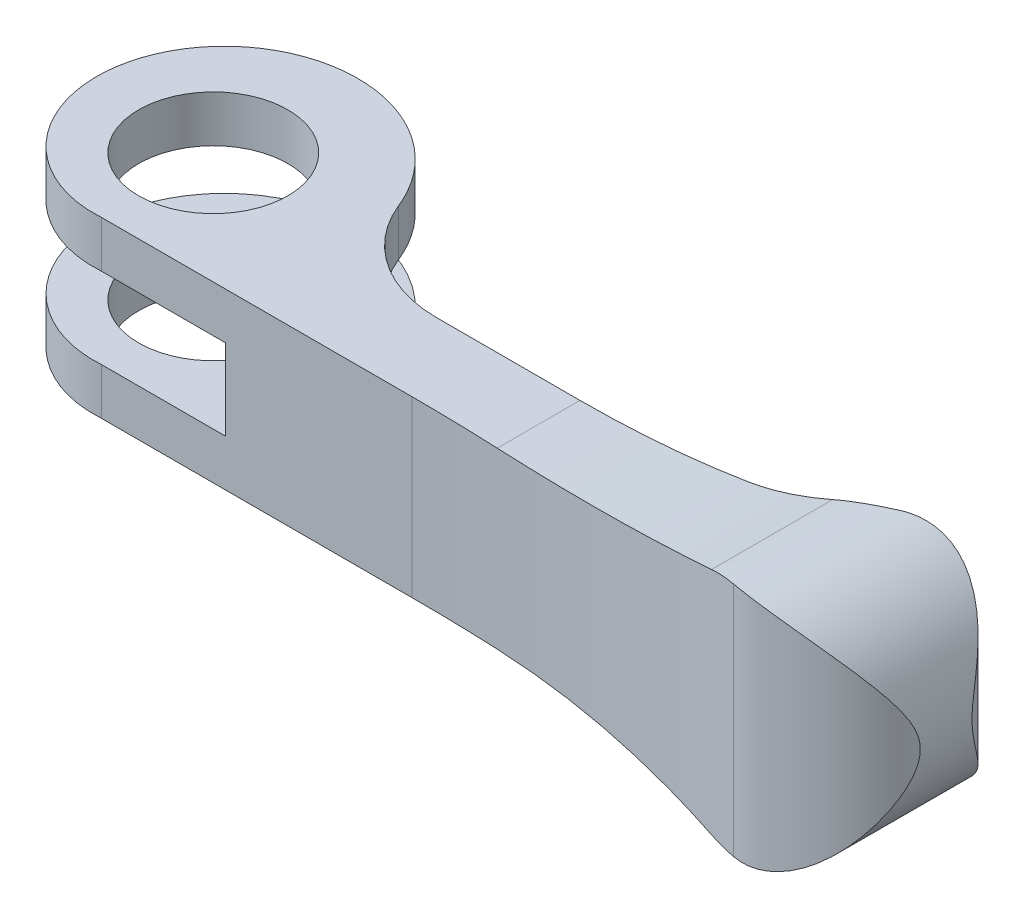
ISO-10303-21;
HEADER;
FILE_DESCRIPTION(('STEP AP214'),'2;1');
FILE_NAME('part.step','',(''),(''),'','','');
FILE_SCHEMA(('AUTOMOTIVE_DESIGN { 1 0 10303 214 1 1 1 1 }'));
ENDSEC;
DATA;
#1=APPLICATION_CONTEXT('core data for automotive mechanical design processes');
#2=APPLICATION_PROTOCOL_DEFINITION('international standard','automotive_design',2000,#1);
#3=PRODUCT_CONTEXT('',#1,'mechanical');
#4=PRODUCT('Part','Part','',(#3));
#5=PRODUCT_RELATED_PRODUCT_CATEGORY('part','',(#4));
#6=PRODUCT_DEFINITION_FORMATION('','',#4);
#7=PRODUCT_DEFINITION_CONTEXT('part definition',#1,'design');
#8=PRODUCT_DEFINITION('design','',#6,#7);
#9=PRODUCT_DEFINITION_SHAPE('','',#8);
#10=(LENGTH_UNIT() NAMED_UNIT(*) SI_UNIT(.MILLI.,.METRE.));
#11=(NAMED_UNIT(*) PLANE_ANGLE_UNIT() SI_UNIT($,.RADIAN.));
#12=(NAMED_UNIT(*) SI_UNIT($,.STERADIAN.) SOLID_ANGLE_UNIT());
#13=UNCERTAINTY_MEASURE_WITH_UNIT(LENGTH_MEASURE(1.E-05),#10,'distance_accuracy_value','');
#14=(GEOMETRIC_REPRESENTATION_CONTEXT(3) GLOBAL_UNCERTAINTY_ASSIGNED_CONTEXT((#13)) GLOBAL_UNIT_ASSIGNED_CONTEXT((#10,
#11,#12)) REPRESENTATION_CONTEXT('',''));
#15=CARTESIAN_POINT('',(0.,0.,0.));
#16=DIRECTION('',(0.,0.,1.));
#17=DIRECTION('',(1.,0.,0.));
#18=AXIS2_PLACEMENT_3D('',#15,#16,#17);
#19=CARTESIAN_POINT('',(58.,9.499823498,4.25));
#20=DIRECTION('',(0.,1.,0.));
#21=DIRECTION('',(1.,0.,0.));
#22=AXIS2_PLACEMENT_3D('',#19,#20,#21);
#23=CYLINDRICAL_SURFACE('',#22,5.5);
#24=DIRECTION('',(0.,-1.,0.));
#25=VECTOR('',#24,1.);
#26=CARTESIAN_POINT('',(54.9597606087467,0.,-0.333333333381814));
#27=LINE('',#26,#25);
#28=CARTESIAN_POINT('',(54.9597606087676,9.38717736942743,-0.333333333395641));
#29=VERTEX_POINT('',#28);
#30=CARTESIAN_POINT('',(54.9597606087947,-9.38717736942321,-0.333333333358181));
#31=VERTEX_POINT('',#30);
#32=EDGE_CURVE('E137',#29,#31,#27,.T.);
#33=ORIENTED_EDGE('',*,*,#32,.F.);
#34=CARTESIAN_POINT('',(54.95976060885,-9.38717736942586,-0.333333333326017));
#35=CARTESIAN_POINT('',(55.077367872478,-9.36890911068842,-0.41137983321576));
#36=CARTESIAN_POINT('',(55.1977194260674,-9.34791083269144,-0.484658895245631));
#37=CARTESIAN_POINT('',(55.4427610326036,-9.30006230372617,-0.621357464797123));
#38=CARTESIAN_POINT('',(55.5674506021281,-9.27321270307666,-0.684778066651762));
#39=CARTESIAN_POINT('',(55.8194926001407,-9.21339676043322,-0.801197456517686));
#40=CARTESIAN_POINT('',(55.9468310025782,-9.18045767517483,-0.854240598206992));
#41=CARTESIAN_POINT('',(56.2035035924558,-9.10817413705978,-0.950131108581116));
#42=CARTESIAN_POINT('',(56.3328377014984,-9.06882993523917,-0.992978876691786));
#43=CARTESIAN_POINT('',(56.5923409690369,-8.98365625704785,-1.06853019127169));
#44=CARTESIAN_POINT('',(56.7225102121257,-8.93782611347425,-1.10123269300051));
#45=CARTESIAN_POINT('',(56.9825895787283,-8.83973380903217,-1.15671474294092));
#46=CARTESIAN_POINT('',(57.1124995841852,-8.78746919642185,-1.17949049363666));
#47=CARTESIAN_POINT('',(57.3709731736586,-8.67671230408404,-1.2154691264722));
#48=CARTESIAN_POINT('',(57.4995367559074,-8.61822001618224,-1.22867199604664));
#49=CARTESIAN_POINT('',(57.7544505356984,-8.49527447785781,-1.24600180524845));
#50=CARTESIAN_POINT('',(57.8807998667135,-8.43081895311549,-1.25012526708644));
#51=CARTESIAN_POINT('',(58.1354039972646,-8.29365707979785,-1.24986389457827));
#52=CARTESIAN_POINT('',(58.2635369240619,-8.2207253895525,-1.2451365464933));
#53=CARTESIAN_POINT('',(58.5158561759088,-8.06925529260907,-1.22721718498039));
#54=CARTESIAN_POINT('',(58.6400409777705,-7.99071475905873,-1.21402194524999));
#55=CARTESIAN_POINT('',(59.0058703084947,-7.74732331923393,-1.16283804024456));
#56=CARTESIAN_POINT('',(59.2408382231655,-7.57467637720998,-1.1132505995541));
#57=CARTESIAN_POINT('',(59.6405000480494,-7.25224867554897,-1.00279669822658));
#58=CARTESIAN_POINT('',(59.8093026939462,-7.1057598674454,-0.946790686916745));
#59=CARTESIAN_POINT('',(60.1338026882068,-6.80380601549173,-0.822187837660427));
#60=CARTESIAN_POINT('',(60.2894939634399,-6.64833686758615,-0.753585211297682));
#61=CARTESIAN_POINT('',(60.737159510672,-6.16965633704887,-0.532149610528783));
#62=CARTESIAN_POINT('',(61.00914008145,-5.83465093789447,-0.363866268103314));
#63=CARTESIAN_POINT('',(61.4235422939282,-5.24910885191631,-0.0596750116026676));
#64=CARTESIAN_POINT('',(61.5799158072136,-5.00481266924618,0.0699620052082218));
#65=CARTESIAN_POINT('',(61.868655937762,-4.50541800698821,0.335670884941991));
#66=CARTESIAN_POINT('',(62.0010048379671,-4.25031172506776,0.471747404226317));
#67=CARTESIAN_POINT('',(62.2420592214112,-3.72945906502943,0.744579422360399));
#68=CARTESIAN_POINT('',(62.3507627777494,-3.46371182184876,0.88133497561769));
#69=CARTESIAN_POINT('',(62.4960827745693,-3.05633788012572,1.08107938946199));
#70=CARTESIAN_POINT('',(62.5415544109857,-2.91913594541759,1.1467412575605));
#71=CARTESIAN_POINT('',(62.6265387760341,-2.64147462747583,1.27493106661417));
#72=CARTESIAN_POINT('',(62.6660526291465,-2.50101586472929,1.3374595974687));
#73=CARTESIAN_POINT('',(62.7352602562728,-2.23099374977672,1.45155392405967));
#74=CARTESIAN_POINT('',(62.7655448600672,-2.10178327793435,1.50358707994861));
#75=CARTESIAN_POINT('',(62.8210209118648,-1.84024320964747,1.60217926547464));
#76=CARTESIAN_POINT('',(62.8462114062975,-1.70791303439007,1.64873726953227));
#77=CARTESIAN_POINT('',(62.913546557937,-1.30693712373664,1.77687183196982));
#78=CARTESIAN_POINT('',(62.9478093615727,-1.03294902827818,1.84752472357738));
#79=CARTESIAN_POINT('',(62.9792394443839,-0.638403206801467,1.91384255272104));
#80=CARTESIAN_POINT('',(62.9863823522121,-0.521835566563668,1.92919711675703));
#81=CARTESIAN_POINT('',(62.9963655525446,-0.287659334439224,1.95076562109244));
#82=CARTESIAN_POINT('',(62.9992066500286,-0.170050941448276,1.95698127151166));
#83=CARTESIAN_POINT('',(63.0005043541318,0.0652570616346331,1.95981244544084));
#84=CARTESIAN_POINT('',(62.9989627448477,0.182956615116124,1.95643187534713));
#85=CARTESIAN_POINT('',(62.9915442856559,0.417578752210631,1.94033346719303));
#86=CARTESIAN_POINT('',(62.9856666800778,0.534501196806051,1.92761400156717));
#87=CARTESIAN_POINT('',(62.9671241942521,0.804582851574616,1.88815792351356));
#88=CARTESIAN_POINT('',(62.9528738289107,0.957163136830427,1.85820837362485));
#89=CARTESIAN_POINT('',(62.9174718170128,1.25870132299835,1.78625079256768));
#90=CARTESIAN_POINT('',(62.8963128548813,1.40765520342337,1.74422998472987));
#91=CARTESIAN_POINT('',(62.8474137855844,1.70244325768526,1.65089085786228));
#92=CARTESIAN_POINT('',(62.819635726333,1.84825394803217,1.59951934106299));
#93=CARTESIAN_POINT('',(62.7579247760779,2.13599576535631,1.4902741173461));
#94=CARTESIAN_POINT('',(62.7239935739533,2.27792794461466,1.4324021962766));
#95=CARTESIAN_POINT('',(62.6509535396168,2.55542776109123,1.31343681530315));
#96=CARTESIAN_POINT('',(62.6119650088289,2.6910662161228,1.25243363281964));
#97=CARTESIAN_POINT('',(62.528409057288,2.95931684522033,1.12763483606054));
#98=CARTESIAN_POINT('',(62.4838406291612,3.09192846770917,1.06383871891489));
#99=CARTESIAN_POINT('',(62.3417972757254,3.48577909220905,0.870000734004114));
#100=CARTESIAN_POINT('',(62.2360216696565,3.74289292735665,0.737572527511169));
#101=CARTESIAN_POINT('',(62.0024548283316,4.24678344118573,0.473565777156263));
#102=CARTESIAN_POINT('',(61.874696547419,4.49357491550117,0.34198626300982));
#103=CARTESIAN_POINT('',(61.5966998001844,4.97706932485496,0.084709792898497));
#104=CARTESIAN_POINT('',(61.4464754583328,5.21377847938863,-0.0409907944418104));
#105=CARTESIAN_POINT('',(61.0477360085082,5.78378188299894,-0.337854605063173));
#106=CARTESIAN_POINT('',(60.7858868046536,6.1111388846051,-0.503171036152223));
#107=CARTESIAN_POINT('',(60.3554057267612,6.58015396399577,-0.722725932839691));
#108=CARTESIAN_POINT('',(60.2056819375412,6.73277650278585,-0.791156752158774));
#109=CARTESIAN_POINT('',(59.8936577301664,7.02975597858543,-0.916458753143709));
#110=CARTESIAN_POINT('',(59.7313608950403,7.17411525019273,-0.973333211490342));
#111=CARTESIAN_POINT('',(59.4348764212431,7.41990350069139,-1.06121448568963));
#112=CARTESIAN_POINT('',(59.3032263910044,7.52335469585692,-1.09515533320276));
#113=CARTESIAN_POINT('',(59.0333127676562,7.72403458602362,-1.15382530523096));
#114=CARTESIAN_POINT('',(58.8950509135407,7.8212649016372,-1.17855683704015));
#115=CARTESIAN_POINT('',(58.6125421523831,8.00878525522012,-1.21764264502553));
#116=CARTESIAN_POINT('',(58.4682977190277,8.09907811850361,-1.23200116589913));
#117=CARTESIAN_POINT('',(58.1746241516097,8.27205677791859,-1.24919419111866));
#118=CARTESIAN_POINT('',(58.0251950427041,8.35474261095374,-1.25202875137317));
#119=CARTESIAN_POINT('',(57.7207413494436,8.51264010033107,-1.24503694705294));
#120=CARTESIAN_POINT('',(57.5656750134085,8.5877661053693,-1.23508001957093));
#121=CARTESIAN_POINT('',(57.2529183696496,8.7289771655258,-1.20129407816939));
#122=CARTESIAN_POINT('',(57.0952278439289,8.79506146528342,-1.17746390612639));
#123=CARTESIAN_POINT('',(56.7791888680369,8.91771344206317,-1.11521396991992));
#124=CARTESIAN_POINT('',(56.6208412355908,8.97429058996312,-1.07680885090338));
#125=CARTESIAN_POINT('',(56.3054455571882,9.07783185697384,-0.985022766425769));
#126=CARTESIAN_POINT('',(56.1483969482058,9.1248003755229,-0.931648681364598));
#127=CARTESIAN_POINT('',(55.8142504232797,9.215665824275,-0.800672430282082));
#128=CARTESIAN_POINT('',(55.637678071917,9.25804562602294,-0.72063716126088));
#129=CARTESIAN_POINT('',(55.3786428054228,9.31281532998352,-0.586112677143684));
#130=CARTESIAN_POINT('',(55.2932605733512,9.32960638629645,-0.53885417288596));
#131=CARTESIAN_POINT('',(55.1247400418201,9.36042496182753,-0.439609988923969));
#132=CARTESIAN_POINT('',(55.0416024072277,9.37445166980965,-0.387622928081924));
#133=CARTESIAN_POINT('',(54.959760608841,9.38717736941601,-0.333333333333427));
#134=B_SPLINE_CURVE_WITH_KNOTS('',3,(#34,#35,#36,#37,#38,#39,#40,#41,#42,#43,#44,#45,#46,#47,
#48,#49,#50,#51,#52,#53,#54,#55,#56,#57,#58,#59,#60,#61,#62,#63,#64,#65,#66,#67,#68,#69,#70,#71,
#72,#73,#74,#75,#76,#77,#78,#79,#80,#81,#82,#83,#84,#85,#86,#87,#88,#89,#90,#91,#92,#93,#94,#95,
#96,#97,#98,#99,#100,#101,#102,#103,#104,#105,#106,#107,#108,#109,#110,#111,#112,#113,#114,#115,
#116,#117,#118,#119,#120,#121,#122,#123,#124,#125,#126,#127,#128,#129,#130,#131,#132,#133),
.UNSPECIFIED.,.F.,.F.,(4,2,2,2,2,2,2,2,2,2,2,2,2,2,2,2,2,2,2,2,2,2,2,2,2,2,2,2,2,2,2,2,2,2,2,2,
2,2,2,2,2,2,2,2,2,2,2,2,2,4),(0.,0.426851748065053,0.853656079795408,1.27859434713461,
1.70351596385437,2.1284813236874,2.55360911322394,2.97873746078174,3.40402862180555,
3.84611889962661,4.28837771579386,5.17273157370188,5.86308835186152,6.55376316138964,
7.93741513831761,8.88954572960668,9.84237564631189,10.7952831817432,11.2714126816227,
11.7474522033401,12.1748586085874,12.6023449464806,13.4527474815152,13.8057598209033,
14.1587060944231,14.5115087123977,14.8643728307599,15.331970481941,15.8000648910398,
16.2709106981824,16.7416274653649,17.2027016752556,17.6638592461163,18.5866496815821,
19.5080686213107,20.4289106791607,21.7754486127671,22.4482830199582,23.1209263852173,
23.6330101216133,24.1449599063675,24.6567000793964,25.168437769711,25.6854405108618,
26.202486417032,26.7190141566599,27.2353048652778,27.8290271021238,28.1259435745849,
28.4229470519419),.UNSPECIFIED.);
#135=EDGE_CURVE('E192',#31,#29,#134,.T.);
#136=ORIENTED_EDGE('',*,*,#135,.F.);
#137=EDGE_LOOP('',(#33,#136));
#138=FACE_BOUND('',#137,.T.);
#139=ADVANCED_FACE('F14',(#138),#23,.T.);
#140=CARTESIAN_POINT('',(0.,7.,0.));
#141=DIRECTION('',(0.,-1.,0.));
#142=DIRECTION('',(0.,0.,1.));
#143=AXIS2_PLACEMENT_3D('',#140,#141,#142);
#144=CYLINDRICAL_SURFACE('',#143,6.);
#145=CARTESIAN_POINT('',(0.,7.,0.));
#146=DIRECTION('',(0.,-1.,0.));
#147=DIRECTION('',(0.,0.,1.));
#148=AXIS2_PLACEMENT_3D('',#145,#146,#147);
#149=CIRCLE('',#148,6.);
#150=CARTESIAN_POINT('',(0.,7.,6.));
#151=VERTEX_POINT('',#150);
#152=EDGE_CURVE('E233',#151,#151,#149,.T.);
#153=ORIENTED_EDGE('',*,*,#152,.F.);
#154=EDGE_LOOP('',(#153));
#155=FACE_BOUND('',#154,.T.);
#156=CARTESIAN_POINT('',(0.,3.25,0.));
#157=DIRECTION('',(0.,-1.,0.));
#158=DIRECTION('',(0.,0.,1.));
#159=AXIS2_PLACEMENT_3D('',#156,#157,#158);
#160=CIRCLE('',#159,6.);
#161=CARTESIAN_POINT('',(0.,3.25,6.));
#162=VERTEX_POINT('',#161);
#163=EDGE_CURVE('E272',#162,#162,#160,.F.);
#164=ORIENTED_EDGE('',*,*,#163,.F.);
#165=EDGE_LOOP('',(#164));
#166=FACE_BOUND('',#165,.T.);
#167=ADVANCED_FACE('F202',(#155,#166),#144,.F.);
#168=CARTESIAN_POINT('',(20.417560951,3.25,-7.5));
#169=DIRECTION('',(0.,1.,0.));
#170=DIRECTION('',(0.,0.,-1.));
#171=AXIS2_PLACEMENT_3D('',#168,#169,#170);
#172=CYLINDRICAL_SURFACE('',#171,10.);
#173=CARTESIAN_POINT('',(20.417560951,3.2499999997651,-7.5));
#174=DIRECTION('',(0.,1.,0.));
#175=DIRECTION('',(0.,0.,-1.));
#176=AXIS2_PLACEMENT_3D('',#173,#174,#175);
#177=CIRCLE('',#176,10.);
#178=CARTESIAN_POINT('',(11.1333903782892,3.24999999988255,-3.78460274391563));
#179=VERTEX_POINT('',#178);
#180=CARTESIAN_POINT('',(20.417560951,3.24999999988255,2.5));
#181=VERTEX_POINT('',#180);
#182=EDGE_CURVE('E245',#179,#181,#177,.T.);
#183=ORIENTED_EDGE('',*,*,#182,.F.);
#184=DIRECTION('',(0.,1.,0.));
#185=VECTOR('',#184,1.);
#186=CARTESIAN_POINT('',(11.133390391,5.125,-3.784602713));
#187=LINE('',#186,#185);
#188=CARTESIAN_POINT('',(11.1333903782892,6.99999999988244,-3.78460274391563));
#189=VERTEX_POINT('',#188);
#190=EDGE_CURVE('E244',#189,#179,#187,.F.);
#191=ORIENTED_EDGE('',*,*,#190,.F.);
#192=CARTESIAN_POINT('',(20.417560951,6.99999999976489,-7.5));
#193=DIRECTION('',(0.,1.,0.));
#194=DIRECTION('',(0.,0.,-1.));
#195=AXIS2_PLACEMENT_3D('',#192,#193,#194);
#196=CIRCLE('',#195,10.);
#197=CARTESIAN_POINT('',(20.417560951,6.99999999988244,2.5));
#198=VERTEX_POINT('',#197);
#199=EDGE_CURVE('E229',#198,#189,#196,.F.);
#200=ORIENTED_EDGE('',*,*,#199,.F.);
#201=DIRECTION('',(0.,-1.,0.));
#202=VECTOR('',#201,1.);
#203=CARTESIAN_POINT('',(20.417560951,-9.5,2.5));
#204=LINE('',#203,#202);
#205=EDGE_CURVE('E333',#181,#198,#204,.F.);
#206=ORIENTED_EDGE('',*,*,#205,.F.);
#207=EDGE_LOOP('',(#183,#191,#200,#206));
#208=FACE_BOUND('',#207,.T.);
#209=ADVANCED_FACE('F206',(#208),#172,.F.);
#210=CARTESIAN_POINT('',(45.562657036,-9.614,-14.5));
#211=DIRECTION('',(0.,1.,0.));
#212=DIRECTION('',(1.,0.,0.));
#213=AXIS2_PLACEMENT_3D('',#210,#211,#212);
#214=CYLINDRICAL_SURFACE('',#213,17.);
#215=CARTESIAN_POINT('',(54.959760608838,9.38717736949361,-0.33333333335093));
#216=CARTESIAN_POINT('',(54.7316206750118,9.42267662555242,-0.181950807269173));
#217=CARTESIAN_POINT('',(54.4988376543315,9.45033434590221,-0.0355271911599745));
#218=CARTESIAN_POINT('',(54.0250539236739,9.48845532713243,0.246646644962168));
#219=CARTESIAN_POINT('',(53.7840411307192,9.4988920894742,0.382380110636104));
#220=CARTESIAN_POINT('',(53.3000815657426,9.50092219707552,0.639552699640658));
#221=CARTESIAN_POINT('',(53.0572524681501,9.49285956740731,0.761209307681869));
#222=CARTESIAN_POINT('',(52.5674008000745,9.45729667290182,0.992150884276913));
#223=CARTESIAN_POINT('',(52.3203826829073,9.42981592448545,1.10144814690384));
#224=CARTESIAN_POINT('',(51.9475951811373,9.37315159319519,1.2559775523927));
#225=CARTESIAN_POINT('',(51.8226148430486,9.35161023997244,1.30604046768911));
#226=CARTESIAN_POINT('',(51.5718111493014,9.30314348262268,1.40308902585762));
#227=CARTESIAN_POINT('',(51.4459865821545,9.27619340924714,1.45005920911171));
#228=CARTESIAN_POINT('',(51.3201707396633,9.24653147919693,1.49534419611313));
#229=B_SPLINE_CURVE_WITH_KNOTS('',3,(#215,#216,#217,#218,#219,#220,#221,#222,#223,#224,#225,
#226,#227,#228),.UNSPECIFIED.,.F.,.F.,(4,2,2,2,2,2,4),(0.,0.828239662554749,1.65775258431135,
2.4719647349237,3.2853597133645,3.69427520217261,4.10509997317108),.UNSPECIFIED.);
#230=CARTESIAN_POINT('',(51.3201707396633,9.24653147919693,1.49534419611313));
#231=VERTEX_POINT('',#230);
#232=EDGE_CURVE('E186',#29,#231,#229,.T.);
#233=ORIENTED_EDGE('',*,*,#232,.F.);
#234=ORIENTED_EDGE('',*,*,#32,.T.);
#235=CARTESIAN_POINT('',(51.3201707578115,-9.24653148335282,1.49534418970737));
#236=CARTESIAN_POINT('',(51.4470886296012,-9.27645314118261,1.4496625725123));
#237=CARTESIAN_POINT('',(51.574014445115,-9.30361515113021,1.40226642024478));
#238=CARTESIAN_POINT('',(51.8275849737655,-9.35252360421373,1.30408654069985));
#239=CARTESIAN_POINT('',(51.954229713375,-9.37427058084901,1.25330314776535));
#240=CARTESIAN_POINT('',(52.3331575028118,-9.43152579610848,1.09599379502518));
#241=CARTESIAN_POINT('',(52.5846126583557,-9.45908991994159,0.984444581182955));
#242=CARTESIAN_POINT('',(53.0787391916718,-9.49383563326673,0.750640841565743));
#243=CARTESIAN_POINT('',(53.3214870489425,-9.50134626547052,0.628593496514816));
#244=CARTESIAN_POINT('',(53.8006848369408,-9.49826094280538,0.373082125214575));
#245=CARTESIAN_POINT('',(54.0371368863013,-9.48767115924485,0.239622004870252));
#246=CARTESIAN_POINT('',(54.3865103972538,-9.45927299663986,0.0312812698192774));
#247=CARTESIAN_POINT('',(54.5023311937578,-9.44768227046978,-0.0396880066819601));
#248=CARTESIAN_POINT('',(54.7323937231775,-9.42043911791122,-0.184467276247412));
#249=CARTESIAN_POINT('',(54.8466266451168,-9.40476962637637,-0.258288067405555));
#250=CARTESIAN_POINT('',(54.9597606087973,-9.38717736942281,-0.333333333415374));
#251=B_SPLINE_CURVE_WITH_KNOTS('',3,(#235,#236,#237,#238,#239,#240,#241,#242,#243,#244,#245,
#246,#247,#248,#249,#250),.UNSPECIFIED.,.F.,.F.,(4,2,2,2,2,2,2,4),(0.,0.414420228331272,
0.82879961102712,1.65697801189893,2.471481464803,3.28570726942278,3.69460979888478,
4.10525143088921),.UNSPECIFIED.);
#252=CARTESIAN_POINT('',(51.3201707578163,-9.24653148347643,1.49534418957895));
#253=VERTEX_POINT('',#252);
#254=EDGE_CURVE('E136',#253,#31,#251,.T.);
#255=ORIENTED_EDGE('',*,*,#254,.F.);
#256=CARTESIAN_POINT('',(45.5626570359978,-8.09949257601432,2.5));
#257=CARTESIAN_POINT('',(45.8097323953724,-8.13981531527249,2.50000021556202));
#258=CARTESIAN_POINT('',(46.0565939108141,-8.18123846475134,2.49461289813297));
#259=CARTESIAN_POINT('',(46.5494786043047,-8.26620019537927,2.47312700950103));
#260=CARTESIAN_POINT('',(46.7955018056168,-8.30973871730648,2.45702873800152));
#261=CARTESIAN_POINT('',(47.528010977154,-8.44272958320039,2.39308640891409));
#262=CARTESIAN_POINT('',(48.0126814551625,-8.5351692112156,2.32959170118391));
#263=CARTESIAN_POINT('',(48.973325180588,-8.7270599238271,2.16148595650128));
#264=CARTESIAN_POINT('',(49.449298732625,-8.82651076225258,2.05687636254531));
#265=CARTESIAN_POINT('',(50.3928479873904,-9.03200341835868,1.8067333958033));
#266=CARTESIAN_POINT('',(50.8603357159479,-9.13808848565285,1.66090351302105));
#267=CARTESIAN_POINT('',(51.3201707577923,-9.24653148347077,1.4953441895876));
#268=B_SPLINE_CURVE_WITH_KNOTS('',3,(#256,#257,#258,#259,#260,#261,#262,#263,#264,#265,#266,
#267),.UNSPECIFIED.,.F.,.F.,(4,2,2,2,2,4),(0.,0.750905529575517,1.50179004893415,
2.99221420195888,4.48258605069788,5.98396403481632),.UNSPECIFIED.);
#269=CARTESIAN_POINT('',(45.5626570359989,-8.09949257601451,2.5));
#270=VERTEX_POINT('',#269);
#271=EDGE_CURVE('E217',#270,#253,#268,.T.);
#272=ORIENTED_EDGE('',*,*,#271,.F.);
#273=DIRECTION('',(0.,-1.,0.));
#274=VECTOR('',#273,1.);
#275=CARTESIAN_POINT('',(45.562657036,-9.5,2.5));
#276=LINE('',#275,#274);
#277=CARTESIAN_POINT('',(45.5626570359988,8.0994925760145,2.5));
#278=VERTEX_POINT('',#277);
#279=EDGE_CURVE('E278',#278,#270,#276,.T.);
#280=ORIENTED_EDGE('',*,*,#279,.F.);
#281=CARTESIAN_POINT('',(51.3201707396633,9.24653147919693,1.49534419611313));
#282=CARTESIAN_POINT('',(50.8603356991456,9.13808848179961,1.66090351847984));
#283=CARTESIAN_POINT('',(50.392847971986,9.0320034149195,1.8067334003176));
#284=CARTESIAN_POINT('',(49.4492987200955,8.82651075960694,2.05687636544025));
#285=CARTESIAN_POINT('',(48.9733251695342,8.72705992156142,2.16148595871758));
#286=CARTESIAN_POINT('',(48.0126814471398,8.53516920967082,2.32959170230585));
#287=CARTESIAN_POINT('',(47.5280109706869,8.44272958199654,2.39308640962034));
#288=CARTESIAN_POINT('',(46.7955018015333,8.30973871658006,2.45702873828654));
#289=CARTESIAN_POINT('',(46.5494786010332,8.26620019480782,2.47312700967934));
#290=CARTESIAN_POINT('',(46.056593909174,8.18123846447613,2.49461289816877));
#291=CARTESIAN_POINT('',(45.8097323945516,8.13981531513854,2.50000021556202));
#292=CARTESIAN_POINT('',(45.5626570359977,8.0994925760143,2.5));
#293=B_SPLINE_CURVE_WITH_KNOTS('',3,(#281,#282,#283,#284,#285,#286,#287,#288,#289,#290,#291,
#292),.UNSPECIFIED.,.F.,.F.,(4,2,2,2,2,4),(0.,1.50137797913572,2.99174982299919,
4.48217397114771,5.23305848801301,5.98396401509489),.UNSPECIFIED.);
#294=EDGE_CURVE('E223',#231,#278,#293,.T.);
#295=ORIENTED_EDGE('',*,*,#294,.F.);
#296=EDGE_LOOP('',(#233,#234,#255,#272,#280,#295));
#297=FACE_BOUND('',#296,.T.);
#298=ADVANCED_FACE('F209',(#297),#214,.F.);
#299=CARTESIAN_POINT('',(55.,9.614,3.25));
#300=DIRECTION('',(0.,1.,0.));
#301=DIRECTION('',(1.,0.,0.));
#302=AXIS2_PLACEMENT_3D('',#299,#300,#301);
#303=CYLINDRICAL_SURFACE('',#302,8.5);
#304=CARTESIAN_POINT('',(53.4546519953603,9.49989176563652,11.6083431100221));
#305=CARTESIAN_POINT('',(53.6423127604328,9.50083234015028,11.6430838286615));
#306=CARTESIAN_POINT('',(53.8311858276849,9.49613011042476,11.671424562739));
#307=CARTESIAN_POINT('',(54.2097261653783,9.47533536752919,11.7153150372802));
#308=CARTESIAN_POINT('',(54.399393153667,9.45924660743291,11.7308689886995));
#309=CARTESIAN_POINT('',(54.7767815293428,9.41571735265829,11.7491578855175));
#310=CARTESIAN_POINT('',(54.9645075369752,9.38835160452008,11.7519758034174));
#311=CARTESIAN_POINT('',(55.3377673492,9.32247361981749,11.7453366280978));
#312=CARTESIAN_POINT('',(55.523301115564,9.28396118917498,11.7358793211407));
#313=CARTESIAN_POINT('',(55.8906005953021,9.19623014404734,11.7052210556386));
#314=CARTESIAN_POINT('',(56.0723702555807,9.14702343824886,11.6840331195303));
#315=CARTESIAN_POINT('',(56.4312480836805,9.03841538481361,11.6306002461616));
#316=CARTESIAN_POINT('',(56.6083541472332,8.9790095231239,11.5983504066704));
#317=CARTESIAN_POINT('',(56.9570172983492,8.85062585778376,11.5235666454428));
#318=CARTESIAN_POINT('',(57.1285688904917,8.78163891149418,11.481022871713));
#319=CARTESIAN_POINT('',(57.4652106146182,8.63486225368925,11.3865423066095));
#320=CARTESIAN_POINT('',(57.6302992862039,8.55707056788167,11.3346034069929));
#321=CARTESIAN_POINT('',(58.0048879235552,8.36737473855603,11.2043372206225));
#322=CARTESIAN_POINT('',(58.2118012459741,8.25249324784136,11.1228723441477));
#323=CARTESIAN_POINT('',(58.6125488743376,8.01041377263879,10.9472350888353));
#324=CARTESIAN_POINT('',(58.8063794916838,7.88321233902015,10.8530591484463));
#325=CARTESIAN_POINT('',(59.368253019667,7.48494610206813,10.5539983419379));
#326=CARTESIAN_POINT('',(59.7162473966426,7.19744226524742,10.3327370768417));
#327=CARTESIAN_POINT('',(60.2554647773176,6.68615417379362,9.93609832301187));
#328=CARTESIAN_POINT('',(60.4613320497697,6.47121464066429,9.76853169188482));
#329=CARTESIAN_POINT('',(60.8487479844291,6.02764968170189,9.42328021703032));
#330=CARTESIAN_POINT('',(61.0302853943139,5.79901799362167,9.24559074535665));
#331=CARTESIAN_POINT('',(61.3695876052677,5.32949995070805,8.88381807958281));
#332=CARTESIAN_POINT('',(61.5273458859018,5.08861025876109,8.69973314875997));
#333=CARTESIAN_POINT('',(61.8196898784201,4.59510915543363,8.32911467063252));
#334=CARTESIAN_POINT('',(61.9542851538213,4.34250263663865,8.14258216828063));
#335=CARTESIAN_POINT('',(62.1500966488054,3.93119493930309,7.84818815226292));
#336=CARTESIAN_POINT('',(62.2187352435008,3.77657058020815,7.73950301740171));
#337=CARTESIAN_POINT('',(62.3481454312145,3.46253871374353,7.52439950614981));
#338=CARTESIAN_POINT('',(62.4089181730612,3.30313190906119,7.41798080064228));
#339=CARTESIAN_POINT('',(62.5224836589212,2.9789719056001,7.20933359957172));
#340=CARTESIAN_POINT('',(62.5752820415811,2.81422258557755,7.10710218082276));
#341=CARTESIAN_POINT('',(62.6726915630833,2.4783627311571,6.90949950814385));
#342=CARTESIAN_POINT('',(62.7173060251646,2.30725481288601,6.81412547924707));
#343=CARTESIAN_POINT('',(62.8055783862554,1.92405115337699,6.61699146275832));
#344=CARTESIAN_POINT('',(62.8474386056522,1.71035191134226,6.51747006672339));
#345=CARTESIAN_POINT('',(62.9172695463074,1.27054215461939,6.34444603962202));
#346=CARTESIAN_POINT('',(62.9452779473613,1.04446718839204,6.27087298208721));
#347=CARTESIAN_POINT('',(62.9809754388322,0.62863036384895,6.17509515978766));
#348=CARTESIAN_POINT('',(62.9916525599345,0.440922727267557,6.14545270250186));
#349=CARTESIAN_POINT('',(63.0016637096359,0.0629993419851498,6.11769179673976));
#350=CARTESIAN_POINT('',(63.0010146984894,-0.127212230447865,6.11952621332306));
#351=CARTESIAN_POINT('',(62.9885114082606,-0.503579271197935,6.15412561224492));
#352=CARTESIAN_POINT('',(62.9766945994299,-0.689746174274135,6.1867871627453));
#353=CARTESIAN_POINT('',(62.9430036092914,-1.05525251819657,6.27670246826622));
#354=CARTESIAN_POINT('',(62.9211045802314,-1.23457389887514,6.33401695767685));
#355=CARTESIAN_POINT('',(62.8678869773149,-1.589220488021,6.46739140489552));
#356=CARTESIAN_POINT('',(62.8363627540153,-1.76435807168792,6.54385330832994));
#357=CARTESIAN_POINT('',(62.7649998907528,-2.10724467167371,6.70873757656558));
#358=CARTESIAN_POINT('',(62.7251520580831,-2.27498526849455,6.79717312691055));
#359=CARTESIAN_POINT('',(62.6375427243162,-2.60471151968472,6.98208571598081));
#360=CARTESIAN_POINT('',(62.5897496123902,-2.76667091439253,7.07859407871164));
#361=CARTESIAN_POINT('',(62.4866445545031,-3.08516417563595,7.2764895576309));
#362=CARTESIAN_POINT('',(62.4313301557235,-3.24169625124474,7.37787825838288));
#363=CARTESIAN_POINT('',(62.3156452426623,-3.5439435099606,7.57946989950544));
#364=CARTESIAN_POINT('',(62.2555594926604,-3.68984193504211,7.67956239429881));
#365=CARTESIAN_POINT('',(62.1285986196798,-3.97769004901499,7.88112165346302));
#366=CARTESIAN_POINT('',(62.0617226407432,-4.11963923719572,7.98258858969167));
#367=CARTESIAN_POINT('',(61.8507779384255,-4.54015623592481,8.28764875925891));
#368=CARTESIAN_POINT('',(61.6964443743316,-4.81325829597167,8.49180882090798));
#369=CARTESIAN_POINT('',(61.3602059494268,-5.34469332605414,8.89505859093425));
#370=CARTESIAN_POINT('',(61.1783616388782,-5.60305705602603,9.09415833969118));
#371=CARTESIAN_POINT('',(60.7859874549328,-6.10455825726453,9.4828591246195));
#372=CARTESIAN_POINT('',(60.5754771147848,-6.34770593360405,9.67246650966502));
#373=CARTESIAN_POINT('',(60.1979899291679,-6.74056159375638,9.97824568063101));
#374=CARTESIAN_POINT('',(60.039035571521,-6.89499947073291,10.098291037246));
#375=CARTESIAN_POINT('',(59.70736264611,-7.19504426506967,10.3303744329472));
#376=CARTESIAN_POINT('',(59.5346406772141,-7.3406489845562,10.4424104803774));
#377=CARTESIAN_POINT('',(59.1756380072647,-7.62161599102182,10.6565978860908));
#378=CARTESIAN_POINT('',(58.9893727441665,-7.7569895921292,10.758760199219));
#379=CARTESIAN_POINT('',(58.60339325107,-8.0161936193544,10.9514306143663));
#380=CARTESIAN_POINT('',(58.4036875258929,-8.14003122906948,11.0419459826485));
#381=CARTESIAN_POINT('',(58.030970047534,-8.35206728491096,11.193269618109));
#382=CARTESIAN_POINT('',(57.8602095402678,-8.44253982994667,11.2564434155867));
#383=CARTESIAN_POINT('',(57.5107894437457,-8.61402418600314,11.3727961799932));
#384=CARTESIAN_POINT('',(57.3321335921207,-8.69504040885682,11.4259798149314));
#385=CARTESIAN_POINT('',(56.9676310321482,-8.84672222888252,11.5212699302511));
#386=CARTESIAN_POINT('',(56.7817854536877,-8.91738944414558,11.5633781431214));
#387=CARTESIAN_POINT('',(56.4039095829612,-9.04749788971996,11.6354645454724));
#388=CARTESIAN_POINT('',(56.2118801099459,-9.10694059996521,11.6654443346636));
#389=CARTESIAN_POINT('',(55.8435648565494,-9.20816056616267,11.7098504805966));
#390=CARTESIAN_POINT('',(55.667767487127,-9.25114238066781,11.7255885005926));
#391=CARTESIAN_POINT('',(55.3133957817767,-9.32707979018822,11.7460737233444));
#392=CARTESIAN_POINT('',(55.1348218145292,-9.36003670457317,11.7508223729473));
#393=CARTESIAN_POINT('',(54.7764248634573,-9.41560290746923,11.7489459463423));
#394=CARTESIAN_POINT('',(54.5966043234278,-9.43822860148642,11.7423389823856));
#395=CARTESIAN_POINT('',(54.2368228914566,-9.47310516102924,11.7175875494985));
#396=CARTESIAN_POINT('',(54.0568621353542,-9.4853618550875,11.6994495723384));
#397=CARTESIAN_POINT('',(53.806768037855,-9.49531035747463,11.6661334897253));
#398=CARTESIAN_POINT('',(53.7361117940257,-9.4973275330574,11.6558128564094));
#399=CARTESIAN_POINT('',(53.5951349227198,-9.49978476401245,11.633402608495));
#400=CARTESIAN_POINT('',(53.5248140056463,-9.50022660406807,11.6213150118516));
#401=CARTESIAN_POINT('',(53.4546519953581,-9.49989176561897,11.6083431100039));
#402=B_SPLINE_CURVE_WITH_KNOTS('',3,(#304,#305,#306,#307,#308,#309,#310,#311,#312,#313,#314,
#315,#316,#317,#318,#319,#320,#321,#322,#323,#324,#325,#326,#327,#328,#329,#330,#331,#332,#333,
#334,#335,#336,#337,#338,#339,#340,#341,#342,#343,#344,#345,#346,#347,#348,#349,#350,#351,#352,
#353,#354,#355,#356,#357,#358,#359,#360,#361,#362,#363,#364,#365,#366,#367,#368,#369,#370,#371,
#372,#373,#374,#375,#376,#377,#378,#379,#380,#381,#382,#383,#384,#385,#386,#387,#388,#389,#390,
#391,#392,#393,#394,#395,#396,#397,#398,#399,#400,#401),.UNSPECIFIED.,.F.,.F.,(4,2,2,2,2,2,2,2,
2,2,2,2,2,2,2,2,2,2,2,2,2,2,2,2,2,2,2,2,2,2,2,2,2,2,2,2,2,2,2,2,2,2,2,2,2,2,2,2,4),(0.,
0.572363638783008,1.14453871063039,1.71298076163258,2.28143271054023,2.84925486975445,
3.41732899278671,3.98594896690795,4.554696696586,5.304446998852,6.05440781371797,
7.55583824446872,8.57938545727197,9.60340442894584,10.6277036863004,11.6515790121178,
12.2546292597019,12.8575913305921,13.4601250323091,14.062413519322,14.7793166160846,
15.4942587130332,16.0626680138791,16.6302262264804,17.1958869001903,17.7629491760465,
18.3430932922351,18.9238815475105,19.5070383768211,20.090385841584,20.6507689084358,
21.2112227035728,22.3326442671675,23.4516325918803,24.5698622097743,25.3254388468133,
26.0812027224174,26.8361182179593,27.5905604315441,28.1999306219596,28.8090153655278,
29.4180047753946,30.0269138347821,30.5712883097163,31.1155911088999,31.6590265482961,
32.2021563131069,32.4164283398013,32.6304575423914),.UNSPECIFIED.);
#403=CARTESIAN_POINT('',(53.454651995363,9.49989176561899,11.6083431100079));
#404=VERTEX_POINT('',#403);
#405=CARTESIAN_POINT('',(53.4546519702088,-9.49989176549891,11.6083431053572));
#406=VERTEX_POINT('',#405);
#407=EDGE_CURVE('E18',#404,#406,#402,.T.);
#408=ORIENTED_EDGE('',*,*,#407,.F.);
#409=DIRECTION('',(0.,1.,0.));
#410=VECTOR('',#409,1.);
#411=CARTESIAN_POINT('',(53.4546519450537,0.,11.6083431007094));
#412=LINE('',#411,#410);
#413=EDGE_CURVE('E138',#406,#404,#412,.T.);
#414=ORIENTED_EDGE('',*,*,#413,.F.);
#415=EDGE_LOOP('',(#408,#414));
#416=FACE_BOUND('',#415,.T.);
#417=ADVANCED_FACE('F139',(#416),#303,.T.);
#418=CARTESIAN_POINT('',(53.5,0.,11.864664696));
#419=DIRECTION('',(0.,0.,1.));
#420=DIRECTION('',(-1.,0.,0.));
#421=AXIS2_PLACEMENT_3D('',#418,#419,#420);
#422=CYLINDRICAL_SURFACE('',#421,9.5);
#423=ORIENTED_EDGE('',*,*,#232,.T.);
#424=DIRECTION('',(0.,0.,-1.));
#425=VECTOR('',#424,1.);
#426=CARTESIAN_POINT('',(51.3201708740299,9.24653151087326,6.3621594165));
#427=LINE('',#426,#425);
#428=CARTESIAN_POINT('',(51.3201709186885,9.24653152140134,11.2289746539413));
#429=VERTEX_POINT('',#428);
#430=EDGE_CURVE('E230',#429,#231,#427,.T.);
#431=ORIENTED_EDGE('',*,*,#430,.F.);
#432=CARTESIAN_POINT('',(53.4546519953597,9.49989176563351,11.6083431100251));
#433=CARTESIAN_POINT('',(53.0960295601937,9.49822442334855,11.5420236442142));
#434=CARTESIAN_POINT('',(52.7374703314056,9.47615349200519,11.4770445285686));
#435=CARTESIAN_POINT('',(52.2031056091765,9.41276357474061,11.3820987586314));
#436=CARTESIAN_POINT('',(52.0256662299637,9.38661057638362,11.3508882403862));
#437=CARTESIAN_POINT('',(51.6718458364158,9.32417706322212,11.2892763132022));
#438=CARTESIAN_POINT('',(51.4954698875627,9.28786503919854,11.2588777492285));
#439=CARTESIAN_POINT('',(51.3201709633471,9.24653153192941,11.22897466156));
#440=B_SPLINE_CURVE_WITH_KNOTS('',3,(#432,#433,#434,#435,#436,#437,#438,#439),.UNSPECIFIED.,.F.,
.F.,(4,2,2,4),(0.,1.09305760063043,1.63894568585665,2.18654603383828),.UNSPECIFIED.);
#441=EDGE_CURVE('E134',#404,#429,#440,.T.);
#442=ORIENTED_EDGE('',*,*,#441,.F.);
#443=ORIENTED_EDGE('',*,*,#407,.T.);
#444=CARTESIAN_POINT('',(51.3201708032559,-9.24653149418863,11.2289746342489));
#445=CARTESIAN_POINT('',(51.4954697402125,-9.28786500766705,11.2588777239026));
#446=CARTESIAN_POINT('',(51.6718457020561,-9.32417703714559,11.2892762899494));
#447=CARTESIAN_POINT('',(52.0256661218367,-9.38661055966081,11.3508882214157));
#448=CARTESIAN_POINT('',(52.2031055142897,-9.41276356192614,11.3820987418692));
#449=CARTESIAN_POINT('',(52.7374702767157,-9.47615348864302,11.4770445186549));
#450=CARTESIAN_POINT('',(53.0960295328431,-9.49822442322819,11.5420236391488));
#451=CARTESIAN_POINT('',(53.4546519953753,-9.49989176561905,11.6083431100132));
#452=B_SPLINE_CURVE_WITH_KNOTS('',3,(#444,#445,#446,#447,#448,#449,#450,#451),.UNSPECIFIED.,.F.,
.F.,(4,2,2,4),(0.,0.547600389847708,1.09348851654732,2.18654620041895),.UNSPECIFIED.);
#453=CARTESIAN_POINT('',(51.3201707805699,-9.2465314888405,11.2289746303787));
#454=VERTEX_POINT('',#453);
#455=EDGE_CURVE('E131',#454,#406,#452,.T.);
#456=ORIENTED_EDGE('',*,*,#455,.F.);
#457=DIRECTION('',(0.,0.,1.));
#458=VECTOR('',#457,1.);
#459=CARTESIAN_POINT('',(51.3201707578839,-9.24653148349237,6.3621594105));
#460=LINE('',#459,#458);
#461=EDGE_CURVE('E146',#253,#454,#460,.T.);
#462=ORIENTED_EDGE('',*,*,#461,.F.);
#463=ORIENTED_EDGE('',*,*,#254,.T.);
#464=ORIENTED_EDGE('',*,*,#135,.T.);
#465=EDGE_LOOP('',(#423,#431,#442,#443,#456,#462,#463,#464));
#466=FACE_BOUND('',#465,.T.);
#467=ADVANCED_FACE('F128',(#466),#422,.T.);
#468=CARTESIAN_POINT('',(32.,91.2,1.436942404));
#469=DIRECTION('',(0.,0.,1.));
#470=DIRECTION('',(0.,1.,0.));
#471=AXIS2_PLACEMENT_3D('',#468,#469,#470);
#472=CYLINDRICAL_SURFACE('',#471,84.2);
#473=DIRECTION('',(0.,0.,-1.));
#474=VECTOR('',#473,1.);
#475=CARTESIAN_POINT('',(32.,7.,-11.));
#476=LINE('',#475,#474);
#477=CARTESIAN_POINT('',(32.,7.,9.15661651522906));
#478=VERTEX_POINT('',#477);
#479=CARTESIAN_POINT('',(32.,7.,2.5));
#480=VERTEX_POINT('',#479);
#481=EDGE_CURVE('E232',#478,#480,#476,.T.);
#482=ORIENTED_EDGE('',*,*,#481,.F.);
#483=CARTESIAN_POINT('',(51.3201709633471,9.24653153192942,11.22897466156));
#484=CARTESIAN_POINT('',(50.5337517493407,9.06113515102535,11.0948100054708));
#485=CARTESIAN_POINT('',(49.743804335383,8.88685983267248,10.9662394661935));
#486=CARTESIAN_POINT('',(48.1574843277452,8.56083607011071,10.7205953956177));
#487=CARTESIAN_POINT('',(47.3611116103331,8.40908806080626,10.6035220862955));
#488=CARTESIAN_POINT('',(44.9702761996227,7.98928871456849,10.2709822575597));
#489=CARTESIAN_POINT('',(43.3672678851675,7.75507084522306,10.0730279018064));
#490=CARTESIAN_POINT('',(40.1451053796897,7.37919061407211,9.72606815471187));
#491=CARTESIAN_POINT('',(38.5259507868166,7.23753056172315,9.57706398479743));
#492=CARTESIAN_POINT('',(36.0870215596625,7.09528165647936,9.39104421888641));
#493=CARTESIAN_POINT('',(35.2705716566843,7.0595716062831,9.33520563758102));
#494=CARTESIAN_POINT('',(33.6361961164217,7.01192923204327,9.23630636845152));
#495=CARTESIAN_POINT('',(32.818270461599,6.99999719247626,9.19324583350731));
#496=CARTESIAN_POINT('',(31.9999999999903,7.,9.15661651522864));
#497=B_SPLINE_CURVE_WITH_KNOTS('',3,(#483,#484,#485,#486,#487,#488,#489,#490,#491,#492,#493,
#494,#495,#496),.UNSPECIFIED.,.F.,.F.,(4,2,2,2,2,2,4),(0.,2.45692289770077,4.91389322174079,
9.80653646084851,14.6993017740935,17.1563176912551,19.6133630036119),.UNSPECIFIED.);
#498=EDGE_CURVE('E387',#429,#478,#497,.T.);
#499=ORIENTED_EDGE('',*,*,#498,.F.);
#500=ORIENTED_EDGE('',*,*,#430,.T.);
#501=ORIENTED_EDGE('',*,*,#294,.T.);
#502=CARTESIAN_POINT('',(32.,91.2,2.5));
#503=DIRECTION('',(0.,0.,1.));
#504=DIRECTION('',(0.,1.,0.));
#505=AXIS2_PLACEMENT_3D('',#502,#503,#504);
#506=CIRCLE('',#505,84.2);
#507=EDGE_CURVE('E276',#480,#278,#506,.T.);
#508=ORIENTED_EDGE('',*,*,#507,.F.);
#509=EDGE_LOOP('',(#482,#499,#500,#501,#508));
#510=FACE_BOUND('',#509,.T.);
#511=ADVANCED_FACE('F170',(#510),#472,.F.);
#512=CARTESIAN_POINT('',(-11.99581033,7.,-11.));
#513=DIRECTION('',(0.,1.,0.));
#514=DIRECTION('',(1.,0.,0.));
#515=AXIS2_PLACEMENT_3D('',#512,#513,#514);
#516=PLANE('',#515);
#517=ORIENTED_EDGE('',*,*,#152,.T.);
#518=EDGE_LOOP('',(#517));
#519=FACE_BOUND('',#518,.T.);
#520=CARTESIAN_POINT('',(25.,7.0000000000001,165.511363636));
#521=DIRECTION('',(0.,1.,0.));
#522=DIRECTION('',(0.,0.,-1.));
#523=AXIS2_PLACEMENT_3D('',#520,#521,#522);
#524=CIRCLE('',#523,156.511363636);
#525=CARTESIAN_POINT('',(25.,7.,9.));
#526=VERTEX_POINT('',#525);
#527=EDGE_CURVE('E386',#478,#526,#524,.T.);
#528=ORIENTED_EDGE('',*,*,#527,.F.);
#529=ORIENTED_EDGE('',*,*,#481,.T.);
#530=DIRECTION('',(-1.,0.,0.));
#531=VECTOR('',#530,1.);
#532=CARTESIAN_POINT('',(11.834587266,7.,2.5));
#533=LINE('',#532,#531);
#534=EDGE_CURVE('E279',#198,#480,#533,.F.);
#535=ORIENTED_EDGE('',*,*,#534,.F.);
#536=ORIENTED_EDGE('',*,*,#199,.T.);
#537=CARTESIAN_POINT('',(0.,7.,9.));
#538=CARTESIAN_POINT('',(-0.253929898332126,7.,9.01775030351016));
#539=CARTESIAN_POINT('',(-0.508591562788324,7.,9.02456587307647));
#540=CARTESIAN_POINT('',(-1.01756966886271,7.,9.01668385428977));
#541=CARTESIAN_POINT('',(-1.27188613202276,7.,9.00198767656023));
#542=CARTESIAN_POINT('',(-1.77800669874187,7.,8.95147984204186));
#543=CARTESIAN_POINT('',(-2.02981408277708,7.,8.91570091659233));
#544=CARTESIAN_POINT('',(-2.5295949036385,7.,8.82339927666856));
#545=CARTESIAN_POINT('',(-2.77756839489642,7.,8.76687685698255));
#546=CARTESIAN_POINT('',(-3.26928953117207,7.,8.63302807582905));
#547=CARTESIAN_POINT('',(-3.5130068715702,7.,8.55559027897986));
#548=CARTESIAN_POINT('',(-3.99310054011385,7.,8.3805852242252));
#549=CARTESIAN_POINT('',(-4.22947673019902,7.,8.28301758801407));
#550=CARTESIAN_POINT('',(-4.6934313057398,7.,8.06880968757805));
#551=CARTESIAN_POINT('',(-4.92100918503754,7.,7.95216832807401));
#552=CARTESIAN_POINT('',(-5.36591490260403,7.,7.70075787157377));
#553=CARTESIAN_POINT('',(-5.58324246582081,7.,7.56598828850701));
#554=CARTESIAN_POINT('',(-6.01079923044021,7.,7.27615995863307));
#555=CARTESIAN_POINT('',(-6.22077684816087,7.,7.12072860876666));
#556=CARTESIAN_POINT('',(-6.52544524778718,7.,6.87492707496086));
#557=CARTESIAN_POINT('',(-6.62529366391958,7.,6.79087591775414));
#558=CARTESIAN_POINT('',(-6.82138828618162,7.,6.61867147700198));
#559=CARTESIAN_POINT('',(-6.91763449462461,7.,6.53051819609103));
#560=CARTESIAN_POINT('',(-7.20078564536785,7.,6.26017621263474));
#561=CARTESIAN_POINT('',(-7.38212068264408,7.,6.07209117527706));
#562=CARTESIAN_POINT('',(-7.72884451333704,7.,5.68178106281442));
#563=CARTESIAN_POINT('',(-7.8942319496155,7.,5.47955478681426));
#564=CARTESIAN_POINT('',(-8.2114276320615,7.,5.05796741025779));
#565=CARTESIAN_POINT('',(-8.36287497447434,7.,4.83833448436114));
#566=CARTESIAN_POINT('',(-8.64713005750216,7.,4.38734220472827));
#567=CARTESIAN_POINT('',(-8.77993908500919,7.,4.15598366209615));
#568=CARTESIAN_POINT('',(-9.02586408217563,7.,3.6830151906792));
#569=CARTESIAN_POINT('',(-9.13897938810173,7.,3.44140491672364));
#570=CARTESIAN_POINT('',(-9.34497925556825,7.,2.94969934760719));
#571=CARTESIAN_POINT('',(-9.43786221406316,7.,2.69960338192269));
#572=CARTESIAN_POINT('',(-9.60485843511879,7.,2.18726795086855));
#573=CARTESIAN_POINT('',(-9.67852537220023,7.,1.92488301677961));
#574=CARTESIAN_POINT('',(-9.80403688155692,7.,1.39495519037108));
#575=CARTESIAN_POINT('',(-9.8558819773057,7.,1.12741242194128));
#576=CARTESIAN_POINT('',(-9.93740439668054,7.,0.588928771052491));
#577=CARTESIAN_POINT('',(-9.96707879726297,7.,0.317987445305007));
#578=CARTESIAN_POINT('',(-10.0038704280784,7.,-0.225420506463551));
#579=CARTESIAN_POINT('',(-10.010987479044,7.,-0.497887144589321));
#580=CARTESIAN_POINT('',(-10.0029039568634,7.,-1.04846431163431));
#581=CARTESIAN_POINT('',(-9.98721016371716,7.,-1.32656747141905));
#582=CARTESIAN_POINT('',(-9.93299265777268,7.,-1.88054884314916));
#583=CARTESIAN_POINT('',(-9.89446765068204,7.,-2.15642692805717));
#584=CARTESIAN_POINT('',(-9.79494463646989,7.,-2.70412518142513));
#585=CARTESIAN_POINT('',(-9.73394458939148,7.,-2.97594497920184));
#586=CARTESIAN_POINT('',(-9.5898205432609,7.,-3.5136408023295));
#587=CARTESIAN_POINT('',(-9.50669787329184,7.,-3.77951718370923));
#588=CARTESIAN_POINT('',(-9.31667700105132,7.,-4.30940439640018));
#589=CARTESIAN_POINT('',(-9.20928541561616,7.,-4.57323829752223));
#590=CARTESIAN_POINT('',(-8.97303004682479,7.,-5.09111587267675));
#591=CARTESIAN_POINT('',(-8.8441650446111,7.,-5.34515898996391));
#592=CARTESIAN_POINT('',(-8.56603088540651,7.,-5.8418339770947));
#593=CARTESIAN_POINT('',(-8.41675996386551,7.,-6.08446485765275));
#594=CARTESIAN_POINT('',(-8.09886132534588,7.,-6.55671740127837));
#595=CARTESIAN_POINT('',(-7.93023477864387,7.,-6.78633984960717));
#596=CARTESIAN_POINT('',(-7.6617474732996,7.,-7.1221266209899));
#597=CARTESIAN_POINT('',(-7.56860951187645,7.,-7.23372589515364));
#598=CARTESIAN_POINT('',(-7.37771262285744,7.,-7.45289628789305));
#599=CARTESIAN_POINT('',(-7.27995377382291,7.,-7.56046747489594));
#600=CARTESIAN_POINT('',(-6.98004381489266,7.,-7.87689841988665));
#601=CARTESIAN_POINT('',(-6.77123076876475,7.,-8.07951120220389));
#602=CARTESIAN_POINT('',(-6.33765869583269,7.,-8.46683046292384));
#603=CARTESIAN_POINT('',(-6.11289934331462,7.,-8.65153657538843));
#604=CARTESIAN_POINT('',(-5.64904678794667,7.,-9.00197193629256));
#605=CARTESIAN_POINT('',(-5.40995350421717,7.,-9.16770107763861));
#606=CARTESIAN_POINT('',(-4.91450060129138,7.,-9.48197255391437));
#607=CARTESIAN_POINT('',(-4.65790469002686,7.,-9.63014380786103));
#608=CARTESIAN_POINT('',(-4.26446911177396,7.,-9.83590057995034));
#609=CARTESIAN_POINT('',(-4.13188773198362,7.,-9.90174144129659));
#610=CARTESIAN_POINT('',(-3.86408021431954,7.,-10.0278114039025));
#611=CARTESIAN_POINT('',(-3.72885402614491,7.,-10.0880403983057));
#612=CARTESIAN_POINT('',(-3.31961278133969,7.,-10.2602324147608));
#613=CARTESIAN_POINT('',(-3.04198157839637,7.,-10.3637283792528));
#614=CARTESIAN_POINT('',(-2.47921040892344,7.,-10.5476748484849));
#615=CARTESIAN_POINT('',(-2.19406986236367,7.,-10.6281235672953));
#616=CARTESIAN_POINT('',(-1.61285070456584,7.,-10.7668681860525));
#617=CARTESIAN_POINT('',(-1.31666732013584,7.,-10.8247261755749));
#618=CARTESIAN_POINT('',(-0.720531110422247,7.,-10.9157371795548));
#619=CARTESIAN_POINT('',(-0.420578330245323,7.,-10.9488904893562));
#620=CARTESIAN_POINT('',(0.181060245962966,7.,-10.9900465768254));
#621=CARTESIAN_POINT('',(0.482746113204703,7.,-10.9980483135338));
#622=CARTESIAN_POINT('',(1.08576570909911,7.,-10.9892142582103));
#623=CARTESIAN_POINT('',(1.38709940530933,7.,-10.9723763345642));
#624=CARTESIAN_POINT('',(1.9930834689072,7.,-10.9137329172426));
#625=CARTESIAN_POINT('',(2.29768870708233,7.,-10.8714610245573));
#626=CARTESIAN_POINT('',(2.90236666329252,7.,-10.7619690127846));
#627=CARTESIAN_POINT('',(3.2024395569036,7.,-10.6947498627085));
#628=CARTESIAN_POINT('',(3.79603105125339,7.,-10.5357515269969));
#629=CARTESIAN_POINT('',(4.08954930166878,7.,-10.443971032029));
#630=CARTESIAN_POINT('',(4.66794189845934,7.,-10.2363328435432));
#631=CARTESIAN_POINT('',(4.95281605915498,7.,-10.1204746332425));
#632=CARTESIAN_POINT('',(5.51754055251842,7.,-9.863444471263));
#633=CARTESIAN_POINT('',(5.79718846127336,7.,-9.72182796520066));
#634=CARTESIAN_POINT('',(6.34386766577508,7.,-9.41604154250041));
#635=CARTESIAN_POINT('',(6.61089837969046,7.,-9.25187058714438));
#636=CARTESIAN_POINT('',(7.1307074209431,7.,-8.90204848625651));
#637=CARTESIAN_POINT('',(7.38347984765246,7.,-8.7163885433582));
#638=CARTESIAN_POINT('',(7.75044581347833,7.,-8.42279643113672));
#639=CARTESIAN_POINT('',(7.87074357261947,7.,-8.32240790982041));
#640=CARTESIAN_POINT('',(8.10706967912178,7.,-8.11672521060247));
#641=CARTESIAN_POINT('',(8.22309802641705,7.,-8.01143103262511));
#642=CARTESIAN_POINT('',(8.56916645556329,7.,-7.68408292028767));
#643=CARTESIAN_POINT('',(8.79220623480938,7.,-7.45454625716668));
#644=CARTESIAN_POINT('',(9.21851148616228,7.,-6.97777243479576));
#645=CARTESIAN_POINT('',(9.42177294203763,7.,-6.73053169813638));
#646=CARTESIAN_POINT('',(9.80704634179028,7.,-6.22049041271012));
#647=CARTESIAN_POINT('',(9.98908402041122,7.,-5.95770930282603));
#648=CARTESIAN_POINT('',(10.3309240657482,7.,-5.41821747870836));
#649=CARTESIAN_POINT('',(10.4907378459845,7.,-5.14151401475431));
#650=CARTESIAN_POINT('',(10.7304086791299,7.,-4.68391384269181));
#651=CARTESIAN_POINT('',(10.8174991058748,7.,-4.50676762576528));
#652=CARTESIAN_POINT('',(10.9823965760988,7.,-4.14857121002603));
#653=CARTESIAN_POINT('',(11.0602191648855,7.,-3.96752816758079));
#654=CARTESIAN_POINT('',(11.1333903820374,7.,-3.78460273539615));
#655=B_SPLINE_CURVE_WITH_KNOTS('',3,(#537,#538,#539,#540,#541,#542,#543,#544,#545,#546,#547,
#548,#549,#550,#551,#552,#553,#554,#555,#556,#557,#558,#559,#560,#561,#562,#563,#564,#565,#566,
#567,#568,#569,#570,#571,#572,#573,#574,#575,#576,#577,#578,#579,#580,#581,#582,#583,#584,#585,
#586,#587,#588,#589,#590,#591,#592,#593,#594,#595,#596,#597,#598,#599,#600,#601,#602,#603,#604,
#605,#606,#607,#608,#609,#610,#611,#612,#613,#614,#615,#616,#617,#618,#619,#620,#621,#622,#623,
#624,#625,#626,#627,#628,#629,#630,#631,#632,#633,#634,#635,#636,#637,#638,#639,#640,#641,#642,
#643,#644,#645,#646,#647,#648,#649,#650,#651,#652,#653,#654),.UNSPECIFIED.,.F.,.F.,(4,2,2,2,2,2,
2,2,2,2,2,2,2,2,2,2,2,2,2,2,2,2,2,2,2,2,2,2,2,2,2,2,2,2,2,2,2,2,2,2,2,2,2,2,2,2,2,2,2,2,2,2,2,2,
2,2,2,2,4),(0.,0.763367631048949,1.52668520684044,2.2888208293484,3.05094562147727,
3.81721390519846,4.58349659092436,5.34982329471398,6.11617055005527,6.8989247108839,
7.2903730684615,7.68182117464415,8.46464983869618,9.24754506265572,10.0469879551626,
10.8463756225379,11.6457902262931,12.4452681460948,13.2619292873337,14.0785708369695,
14.8953200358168,15.712075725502,16.5467562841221,17.3814841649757,18.2162878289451,
19.0510413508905,19.9045982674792,20.7582036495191,21.6118828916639,22.4655105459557,
22.9014736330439,23.3374293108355,24.2092041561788,25.0809968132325,25.9527943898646,
26.8405856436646,27.2845628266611,27.7285484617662,28.6163393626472,29.504199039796,
30.4085035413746,31.3127972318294,32.217128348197,33.1215370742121,34.0430587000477,
34.9645445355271,35.8860795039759,36.8076342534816,37.7469376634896,38.6862843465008,
39.6260169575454,40.0959481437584,40.5658793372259,41.5248202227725,42.4839554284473,
43.4419152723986,44.3993813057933,44.9913357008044,45.5822827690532),.UNSPECIFIED.);
#656=CARTESIAN_POINT('',(0.,7.,9.));
#657=VERTEX_POINT('',#656);
#658=EDGE_CURVE('E236',#657,#189,#655,.T.);
#659=ORIENTED_EDGE('',*,*,#658,.F.);
#660=DIRECTION('',(1.,0.,0.));
#661=VECTOR('',#660,1.);
#662=CARTESIAN_POINT('',(0.,7.,9.));
#663=LINE('',#662,#661);
#664=EDGE_CURVE('E327',#526,#657,#663,.F.);
#665=ORIENTED_EDGE('',*,*,#664,.F.);
#666=EDGE_LOOP('',(#528,#529,#535,#536,#659,#665));
#667=FACE_BOUND('',#666,.T.);
#668=ADVANCED_FACE('F247',(#519,#667),#516,.T.);
#669=CARTESIAN_POINT('',(0.,3.25,9.));
#670=CARTESIAN_POINT('',(0.,7.,9.));
#671=CARTESIAN_POINT('',(-1.178097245,3.25,9.082375));
#672=CARTESIAN_POINT('',(-1.178097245,7.,9.082375));
#673=CARTESIAN_POINT('',(-2.388891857,3.25,8.930342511));
#674=CARTESIAN_POINT('',(-2.388891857,7.,8.930342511));
#675=CARTESIAN_POINT('',(-4.688551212,3.25,8.156116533));
#676=CARTESIAN_POINT('',(-4.688551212,7.,8.156116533));
#677=CARTESIAN_POINT('',(-5.776412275,3.25,7.533988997));
#678=CARTESIAN_POINT('',(-5.776412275,7.,7.533988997));
#679=CARTESIAN_POINT('',(-7.65048484,3.25,5.892908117));
#680=CARTESIAN_POINT('',(-7.65048484,7.,5.892908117));
#681=CARTESIAN_POINT('',(-8.435776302,3.25,4.874417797));
#682=CARTESIAN_POINT('',(-8.435776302,7.,4.874417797));
#683=CARTESIAN_POINT('',(-9.56393766,3.25,2.581307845));
#684=CARTESIAN_POINT('',(-9.56393766,7.,2.581307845));
#685=CARTESIAN_POINT('',(-9.906125,3.25,1.307491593));
#686=CARTESIAN_POINT('',(-9.906125,7.,1.307491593));
#687=CARTESIAN_POINT('',(-10.070875,3.25,-1.307491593));
#688=CARTESIAN_POINT('',(-10.070875,7.,-1.307491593));
#689=CARTESIAN_POINT('',(-9.893114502,3.25,-2.647629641));
#690=CARTESIAN_POINT('',(-9.893114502,7.,-2.647629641));
#691=CARTESIAN_POINT('',(-9.019854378,3.25,-5.186378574));
#692=CARTESIAN_POINT('',(-9.019854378,7.,-5.186378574));
#693=CARTESIAN_POINT('',(-8.324459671,3.25,-6.383891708));
#694=CARTESIAN_POINT('',(-8.324459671,7.,-6.383891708));
#695=CARTESIAN_POINT('',(-6.50038755,3.25,-8.440955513));
#696=CARTESIAN_POINT('',(-6.50038755,7.,-8.440955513));
#697=CARTESIAN_POINT('',(-5.372245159,3.25,-9.299514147));
#698=CARTESIAN_POINT('',(-5.372245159,7.,-9.299514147));
#699=CARTESIAN_POINT('',(-2.840045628,3.25,-10.526709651));
#700=CARTESIAN_POINT('',(-2.840045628,7.,-10.526709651));
#701=CARTESIAN_POINT('',(-1.43688594,3.25,-10.894625));
#702=CARTESIAN_POINT('',(-1.43688594,7.,-10.894625));
#703=CARTESIAN_POINT('',(1.43688594,3.25,-11.059375));
#704=CARTESIAN_POINT('',(1.43688594,7.,-11.059375));
#705=CARTESIAN_POINT('',(2.906367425,3.25,-10.855886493));
#706=CARTESIAN_POINT('',(2.906367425,7.,-10.855886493));
#707=CARTESIAN_POINT('',(5.684205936,3.25,-9.883592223));
#708=CARTESIAN_POINT('',(5.684205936,7.,-9.883592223));
#709=CARTESIAN_POINT('',(6.99137114,3.25,-9.114930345));
#710=CARTESIAN_POINT('',(6.99137114,7.,-9.114930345));
#711=CARTESIAN_POINT('',(9.231426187,3.25,-7.107866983));
#712=CARTESIAN_POINT('',(9.231426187,7.,-7.107866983));
#713=CARTESIAN_POINT('',(10.163251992,3.25,-5.870072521));
#714=CARTESIAN_POINT('',(10.163251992,7.,-5.870072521));
#715=CARTESIAN_POINT('',(10.936158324,3.25,-4.255007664));
#716=CARTESIAN_POINT('',(10.936158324,7.,-4.255007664));
#717=CARTESIAN_POINT('',(11.038562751,3.25,-4.021561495));
#718=CARTESIAN_POINT('',(11.038562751,7.,-4.021561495));
#719=CARTESIAN_POINT('',(11.133390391,3.25,-3.784602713));
#720=CARTESIAN_POINT('',(11.133390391,7.,-3.784602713));
#721=B_SPLINE_SURFACE_WITH_KNOTS('',3,1,((#669,#670),(#671,#672),(#673,#674),(#675,#676),(#677,
#678),(#679,#680),(#681,#682),(#683,#684),(#685,#686),(#687,#688),(#689,#690),(#691,#692),(#693,
#694),(#695,#696),(#697,#698),(#699,#700),(#701,#702),(#703,#704),(#705,#706),(#707,#708),(#709,
#710),(#711,#712),(#713,#714),(#715,#716),(#717,#718),(#719,#720)),.UNSPECIFIED.,.F.,.F.,.F.,(4,
2,2,2,2,2,2,2,2,2,2,2,4),(2,2),(0.,0.0625,0.125,0.1875,0.25,0.3125,0.375,0.4375,0.5,0.5625,
0.625,0.6875,0.69784808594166),(0.,1.),.UNSPECIFIED.);
#722=CARTESIAN_POINT('',(0.,3.25,9.));
#723=CARTESIAN_POINT('',(-0.253929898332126,3.25,9.01775030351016));
#724=CARTESIAN_POINT('',(-0.508591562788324,3.25,9.02456587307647));
#725=CARTESIAN_POINT('',(-1.01756966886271,3.25,9.01668385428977));
#726=CARTESIAN_POINT('',(-1.27188613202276,3.25,9.00198767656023));
#727=CARTESIAN_POINT('',(-1.77800669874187,3.25,8.95147984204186));
#728=CARTESIAN_POINT('',(-2.02981408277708,3.25,8.91570091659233));
#729=CARTESIAN_POINT('',(-2.5295949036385,3.25,8.82339927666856));
#730=CARTESIAN_POINT('',(-2.77756839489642,3.25,8.76687685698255));
#731=CARTESIAN_POINT('',(-3.26928953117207,3.25,8.63302807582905));
#732=CARTESIAN_POINT('',(-3.5130068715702,3.25,8.55559027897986));
#733=CARTESIAN_POINT('',(-3.99310054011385,3.25,8.3805852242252));
#734=CARTESIAN_POINT('',(-4.22947673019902,3.25,8.28301758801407));
#735=CARTESIAN_POINT('',(-4.6934313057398,3.25,8.06880968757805));
#736=CARTESIAN_POINT('',(-4.92100918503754,3.25,7.95216832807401));
#737=CARTESIAN_POINT('',(-5.36591490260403,3.25,7.70075787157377));
#738=CARTESIAN_POINT('',(-5.58324246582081,3.25,7.56598828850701));
#739=CARTESIAN_POINT('',(-6.01079923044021,3.25,7.27615995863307));
#740=CARTESIAN_POINT('',(-6.22077684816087,3.25,7.12072860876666));
#741=CARTESIAN_POINT('',(-6.52544524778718,3.25,6.87492707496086));
#742=CARTESIAN_POINT('',(-6.62529366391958,3.25,6.79087591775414));
#743=CARTESIAN_POINT('',(-6.82138828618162,3.25,6.61867147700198));
#744=CARTESIAN_POINT('',(-6.91763449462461,3.25,6.53051819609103));
#745=CARTESIAN_POINT('',(-7.20078564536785,3.25,6.26017621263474));
#746=CARTESIAN_POINT('',(-7.38212068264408,3.25,6.07209117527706));
#747=CARTESIAN_POINT('',(-7.72884451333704,3.25,5.68178106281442));
#748=CARTESIAN_POINT('',(-7.8942319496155,3.25,5.47955478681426));
#749=CARTESIAN_POINT('',(-8.2114276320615,3.25,5.05796741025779));
#750=CARTESIAN_POINT('',(-8.36287497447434,3.25,4.83833448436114));
#751=CARTESIAN_POINT('',(-8.64713005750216,3.25,4.38734220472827));
#752=CARTESIAN_POINT('',(-8.77993908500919,3.25,4.15598366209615));
#753=CARTESIAN_POINT('',(-9.02586408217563,3.25,3.6830151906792));
#754=CARTESIAN_POINT('',(-9.13897938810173,3.25,3.44140491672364));
#755=CARTESIAN_POINT('',(-9.34497925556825,3.25,2.94969934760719));
#756=CARTESIAN_POINT('',(-9.43786221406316,3.25,2.69960338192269));
#757=CARTESIAN_POINT('',(-9.60485843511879,3.25,2.18726795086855));
#758=CARTESIAN_POINT('',(-9.67852537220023,3.25,1.92488301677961));
#759=CARTESIAN_POINT('',(-9.80403688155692,3.25,1.39495519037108));
#760=CARTESIAN_POINT('',(-9.8558819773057,3.25,1.12741242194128));
#761=CARTESIAN_POINT('',(-9.93740439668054,3.25,0.588928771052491));
#762=CARTESIAN_POINT('',(-9.96707879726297,3.25,0.317987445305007));
#763=CARTESIAN_POINT('',(-10.0038704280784,3.25,-0.225420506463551));
#764=CARTESIAN_POINT('',(-10.010987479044,3.25,-0.497887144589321));
#765=CARTESIAN_POINT('',(-10.0029039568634,3.25,-1.04846431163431));
#766=CARTESIAN_POINT('',(-9.98721016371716,3.25,-1.32656747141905));
#767=CARTESIAN_POINT('',(-9.93299265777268,3.25,-1.88054884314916));
#768=CARTESIAN_POINT('',(-9.89446765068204,3.25,-2.15642692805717));
#769=CARTESIAN_POINT('',(-9.79494463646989,3.25,-2.70412518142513));
#770=CARTESIAN_POINT('',(-9.73394458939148,3.25,-2.97594497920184));
#771=CARTESIAN_POINT('',(-9.5898205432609,3.25,-3.5136408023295));
#772=CARTESIAN_POINT('',(-9.50669787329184,3.25,-3.77951718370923));
#773=CARTESIAN_POINT('',(-9.31667700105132,3.25,-4.30940439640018));
#774=CARTESIAN_POINT('',(-9.20928541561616,3.25,-4.57323829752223));
#775=CARTESIAN_POINT('',(-8.97303004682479,3.25,-5.09111587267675));
#776=CARTESIAN_POINT('',(-8.8441650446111,3.25,-5.34515898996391));
#777=CARTESIAN_POINT('',(-8.56603088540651,3.25,-5.8418339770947));
#778=CARTESIAN_POINT('',(-8.41675996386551,3.25,-6.08446485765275));
#779=CARTESIAN_POINT('',(-8.09886132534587,3.25,-6.55671740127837));
#780=CARTESIAN_POINT('',(-7.93023477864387,3.25,-6.78633984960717));
#781=CARTESIAN_POINT('',(-7.6617474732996,3.25,-7.1221266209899));
#782=CARTESIAN_POINT('',(-7.56860951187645,3.25,-7.23372589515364));
#783=CARTESIAN_POINT('',(-7.37771262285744,3.25,-7.45289628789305));
#784=CARTESIAN_POINT('',(-7.27995377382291,3.25,-7.56046747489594));
#785=CARTESIAN_POINT('',(-6.98004381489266,3.25,-7.87689841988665));
#786=CARTESIAN_POINT('',(-6.77123076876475,3.25,-8.07951120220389));
#787=CARTESIAN_POINT('',(-6.33765869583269,3.25,-8.46683046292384));
#788=CARTESIAN_POINT('',(-6.11289934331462,3.25,-8.65153657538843));
#789=CARTESIAN_POINT('',(-5.64904678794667,3.25,-9.00197193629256));
#790=CARTESIAN_POINT('',(-5.40995350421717,3.25,-9.16770107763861));
#791=CARTESIAN_POINT('',(-4.91450060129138,3.25,-9.48197255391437));
#792=CARTESIAN_POINT('',(-4.65790469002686,3.25,-9.63014380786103));
#793=CARTESIAN_POINT('',(-4.26446911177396,3.25,-9.83590057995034));
#794=CARTESIAN_POINT('',(-4.13188773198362,3.25,-9.90174144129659));
#795=CARTESIAN_POINT('',(-3.86408021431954,3.25,-10.0278114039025));
#796=CARTESIAN_POINT('',(-3.72885402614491,3.25,-10.0880403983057));
#797=CARTESIAN_POINT('',(-3.31961278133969,3.25,-10.2602324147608));
#798=CARTESIAN_POINT('',(-3.04198157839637,3.25,-10.3637283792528));
#799=CARTESIAN_POINT('',(-2.47921040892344,3.25,-10.5476748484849));
#800=CARTESIAN_POINT('',(-2.19406986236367,3.25,-10.6281235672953));
#801=CARTESIAN_POINT('',(-1.61285070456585,3.25,-10.7668681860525));
#802=CARTESIAN_POINT('',(-1.31666732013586,3.25,-10.8247261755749));
#803=CARTESIAN_POINT('',(-0.720531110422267,3.25,-10.9157371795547));
#804=CARTESIAN_POINT('',(-0.420578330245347,3.25,-10.9488904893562));
#805=CARTESIAN_POINT('',(0.181060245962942,3.25,-10.9900465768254));
#806=CARTESIAN_POINT('',(0.482746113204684,3.25,-10.9980483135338));
#807=CARTESIAN_POINT('',(1.0857657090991,3.25,-10.9892142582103));
#808=CARTESIAN_POINT('',(1.38709940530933,3.25,-10.9723763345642));
#809=CARTESIAN_POINT('',(1.99308346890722,3.25,-10.9137329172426));
#810=CARTESIAN_POINT('',(2.29768870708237,3.25,-10.8714610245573));
#811=CARTESIAN_POINT('',(2.90236666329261,3.25,-10.7619690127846));
#812=CARTESIAN_POINT('',(3.20243955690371,3.25,-10.6947498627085));
#813=CARTESIAN_POINT('',(3.7960310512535,3.25,-10.5357515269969));
#814=CARTESIAN_POINT('',(4.08954930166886,3.25,-10.443971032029));
#815=CARTESIAN_POINT('',(4.66794189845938,3.25,-10.2363328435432));
#816=CARTESIAN_POINT('',(4.952816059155,3.25,-10.1204746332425));
#817=CARTESIAN_POINT('',(5.51754055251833,3.25,-9.86344447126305));
#818=CARTESIAN_POINT('',(5.79718846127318,3.25,-9.72182796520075));
#819=CARTESIAN_POINT('',(6.34386766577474,3.25,-9.41604154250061));
#820=CARTESIAN_POINT('',(6.61089837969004,3.25,-9.25187058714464));
#821=CARTESIAN_POINT('',(7.1307074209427,3.25,-8.9020484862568));
#822=CARTESIAN_POINT('',(7.38347984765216,3.25,-8.71638854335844));
#823=CARTESIAN_POINT('',(7.75044581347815,3.25,-8.42279643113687));
#824=CARTESIAN_POINT('',(7.87074357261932,3.25,-8.32240790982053));
#825=CARTESIAN_POINT('',(8.10706967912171,3.25,-8.11672521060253));
#826=CARTESIAN_POINT('',(8.22309802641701,3.25,-8.01143103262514));
#827=CARTESIAN_POINT('',(8.56916645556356,3.25,-7.68408292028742));
#828=CARTESIAN_POINT('',(8.7922062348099,3.25,-7.45454625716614));
#829=CARTESIAN_POINT('',(9.21851148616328,3.25,-6.97777243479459));
#830=CARTESIAN_POINT('',(9.42177294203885,3.25,-6.73053169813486));
#831=CARTESIAN_POINT('',(9.80704634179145,3.25,-6.22049041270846));
#832=CARTESIAN_POINT('',(9.98908402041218,3.25,-5.95770930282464));
#833=CARTESIAN_POINT('',(10.3309240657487,3.25,-5.41821747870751));
#834=CARTESIAN_POINT('',(10.4907378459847,3.25,-5.14151401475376));
#835=CARTESIAN_POINT('',(10.7304086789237,3.25,-4.68391384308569));
#836=CARTESIAN_POINT('',(10.8174991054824,3.25,-4.50676762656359));
#837=CARTESIAN_POINT('',(10.9823965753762,3.25,-4.14857121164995));
#838=CARTESIAN_POINT('',(11.0602191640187,3.25,-3.96752816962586));
#839=CARTESIAN_POINT('',(11.1333903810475,3.25,-3.78460273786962));
#840=B_SPLINE_CURVE_WITH_KNOTS('',3,(#722,#723,#724,#725,#726,#727,#728,#729,#730,#731,#732,
#733,#734,#735,#736,#737,#738,#739,#740,#741,#742,#743,#744,#745,#746,#747,#748,#749,#750,#751,
#752,#753,#754,#755,#756,#757,#758,#759,#760,#761,#762,#763,#764,#765,#766,#767,#768,#769,#770,
#771,#772,#773,#774,#775,#776,#777,#778,#779,#780,#781,#782,#783,#784,#785,#786,#787,#788,#789,
#790,#791,#792,#793,#794,#795,#796,#797,#798,#799,#800,#801,#802,#803,#804,#805,#806,#807,#808,
#809,#810,#811,#812,#813,#814,#815,#816,#817,#818,#819,#820,#821,#822,#823,#824,#825,#826,#827,
#828,#829,#830,#831,#832,#833,#834,#835,#836,#837,#838,#839),.UNSPECIFIED.,.F.,.F.,(4,2,2,2,2,2,
2,2,2,2,2,2,2,2,2,2,2,2,2,2,2,2,2,2,2,2,2,2,2,2,2,2,2,2,2,2,2,2,2,2,2,2,2,2,2,2,2,2,2,2,2,2,2,2,
2,2,2,2,4),(0.,0.763367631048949,1.52668520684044,2.2888208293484,3.05094562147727,
3.81721390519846,4.58349659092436,5.34982329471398,6.11617055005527,6.8989247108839,
7.2903730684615,7.68182117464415,8.46464983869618,9.24754506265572,10.0469879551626,
10.8463756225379,11.6457902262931,12.4452681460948,13.2619292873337,14.0785708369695,
14.8953200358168,15.712075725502,16.5467562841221,17.3814841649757,18.2162878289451,
19.0510413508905,19.9045982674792,20.7582036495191,21.6118828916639,22.4655105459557,
22.9014736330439,23.3374293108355,24.2092041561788,25.0809968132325,25.9527943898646,
26.8405856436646,27.2845628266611,27.7285484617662,28.6163393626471,29.504199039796,
30.4085035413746,31.3127972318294,32.217128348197,33.1215370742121,34.0430587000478,
34.9645445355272,35.886079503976,36.8076342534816,37.7469376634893,38.6862843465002,
39.6260169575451,40.0959481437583,40.5658793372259,41.5248202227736,42.4839554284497,
43.4419152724,44.3993813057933,44.9913356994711,45.5822827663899),.UNSPECIFIED.);
#841=CARTESIAN_POINT('',(0.,3.25,9.));
#842=VERTEX_POINT('',#841);
#843=EDGE_CURVE('E265',#842,#179,#840,.T.);
#844=DIRECTION('',(0.,-1.,0.));
#845=VECTOR('',#844,1.);
#846=CARTESIAN_POINT('',(0.,-9.5,9.));
#847=LINE('',#846,#845);
#848=EDGE_CURVE('E322',#657,#842,#847,.T.);
#849=ORIENTED_EDGE('',*,*,#843,.F.);
#850=ORIENTED_EDGE('',*,*,#848,.F.);
#851=ORIENTED_EDGE('',*,*,#658,.T.);
#852=ORIENTED_EDGE('',*,*,#190,.T.);
#853=EDGE_LOOP('',(#849,#850,#851,#852));
#854=FACE_BOUND('',#853,.T.);
#855=ADVANCED_FACE('F249',(#854),#721,.F.);
#856=CARTESIAN_POINT('',(10.,3.25,50.));
#857=DIRECTION('',(0.,1.,0.));
#858=DIRECTION('',(1.,0.,0.));
#859=AXIS2_PLACEMENT_3D('',#856,#857,#858);
#860=PLANE('',#859);
#861=ORIENTED_EDGE('',*,*,#163,.T.);
#862=EDGE_LOOP('',(#861));
#863=FACE_BOUND('',#862,.T.);
#864=DIRECTION('',(1.,0.,0.));
#865=VECTOR('',#864,1.);
#866=CARTESIAN_POINT('',(0.,3.25,9.));
#867=LINE('',#866,#865);
#868=CARTESIAN_POINT('',(10.,3.25,9.));
#869=VERTEX_POINT('',#868);
#870=EDGE_CURVE('E300',#842,#869,#867,.T.);
#871=ORIENTED_EDGE('',*,*,#870,.F.);
#872=ORIENTED_EDGE('',*,*,#843,.T.);
#873=ORIENTED_EDGE('',*,*,#182,.T.);
#874=DIRECTION('',(-1.,0.,0.));
#875=VECTOR('',#874,1.);
#876=CARTESIAN_POINT('',(11.834587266,3.25,2.5));
#877=LINE('',#876,#875);
#878=CARTESIAN_POINT('',(10.,3.25,2.5));
#879=VERTEX_POINT('',#878);
#880=EDGE_CURVE('E313',#879,#181,#877,.F.);
#881=ORIENTED_EDGE('',*,*,#880,.F.);
#882=DIRECTION('',(0.,0.,1.));
#883=VECTOR('',#882,1.);
#884=CARTESIAN_POINT('',(10.,3.25,50.));
#885=LINE('',#884,#883);
#886=EDGE_CURVE('E275',#869,#879,#885,.F.);
#887=ORIENTED_EDGE('',*,*,#886,.F.);
#888=EDGE_LOOP('',(#871,#872,#873,#881,#887));
#889=FACE_BOUND('',#888,.T.);
#890=ADVANCED_FACE('F255',(#863,#889),#860,.F.);
#891=CARTESIAN_POINT('',(10.,-3.25,50.));
#892=DIRECTION('',(1.,0.,0.));
#893=DIRECTION('',(0.,0.,1.));
#894=AXIS2_PLACEMENT_3D('',#891,#892,#893);
#895=PLANE('',#894);
#896=DIRECTION('',(0.,0.,-1.));
#897=VECTOR('',#896,1.);
#898=CARTESIAN_POINT('',(10.,-3.25,50.));
#899=LINE('',#898,#897);
#900=CARTESIAN_POINT('',(10.,-3.25,9.));
#901=VERTEX_POINT('',#900);
#902=CARTESIAN_POINT('',(10.,-3.25,2.5));
#903=VERTEX_POINT('',#902);
#904=EDGE_CURVE('E303',#901,#903,#899,.T.);
#905=ORIENTED_EDGE('',*,*,#904,.F.);
#906=DIRECTION('',(0.,-1.,0.));
#907=VECTOR('',#906,1.);
#908=CARTESIAN_POINT('',(10.,-9.5,9.));
#909=LINE('',#908,#907);
#910=EDGE_CURVE('E296',#869,#901,#909,.T.);
#911=ORIENTED_EDGE('',*,*,#910,.F.);
#912=ORIENTED_EDGE('',*,*,#886,.T.);
#913=DIRECTION('',(0.,-1.,0.));
#914=VECTOR('',#913,1.);
#915=CARTESIAN_POINT('',(10.,-9.5,2.5));
#916=LINE('',#915,#914);
#917=EDGE_CURVE('E310',#903,#879,#916,.F.);
#918=ORIENTED_EDGE('',*,*,#917,.F.);
#919=EDGE_LOOP('',(#905,#911,#912,#918));
#920=FACE_BOUND('',#919,.T.);
#921=ADVANCED_FACE('F439',(#920),#895,.F.);
#922=CARTESIAN_POINT('',(20.417560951,-7.,-7.5));
#923=DIRECTION('',(0.,1.,0.));
#924=DIRECTION('',(0.,0.,-1.));
#925=AXIS2_PLACEMENT_3D('',#922,#923,#924);
#926=CYLINDRICAL_SURFACE('',#925,10.);
#927=DIRECTION('',(0.,1.,0.));
#928=VECTOR('',#927,1.);
#929=CARTESIAN_POINT('',(11.133390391,-5.125,-3.784602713));
#930=LINE('',#929,#928);
#931=CARTESIAN_POINT('',(11.1333903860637,-3.24999999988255,-3.78460272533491));
#932=VERTEX_POINT('',#931);
#933=CARTESIAN_POINT('',(11.1333903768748,-7.00000000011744,-3.7846027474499));
#934=VERTEX_POINT('',#933);
#935=EDGE_CURVE('E299',#932,#934,#930,.F.);
#936=ORIENTED_EDGE('',*,*,#935,.F.);
#937=CARTESIAN_POINT('',(20.417560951,-3.2499999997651,-7.5));
#938=DIRECTION('',(0.,1.,0.));
#939=DIRECTION('',(0.,0.,-1.));
#940=AXIS2_PLACEMENT_3D('',#937,#938,#939);
#941=CIRCLE('',#940,10.);
#942=CARTESIAN_POINT('',(20.417560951,-3.24999999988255,2.5));
#943=VERTEX_POINT('',#942);
#944=EDGE_CURVE('E382',#943,#932,#941,.F.);
#945=ORIENTED_EDGE('',*,*,#944,.F.);
#946=DIRECTION('',(0.,-1.,0.));
#947=VECTOR('',#946,1.);
#948=CARTESIAN_POINT('',(20.417560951,-9.5,2.5));
#949=LINE('',#948,#947);
#950=CARTESIAN_POINT('',(20.417560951,-7.00000000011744,2.5));
#951=VERTEX_POINT('',#950);
#952=EDGE_CURVE('E282',#951,#943,#949,.F.);
#953=ORIENTED_EDGE('',*,*,#952,.F.);
#954=CARTESIAN_POINT('',(20.417560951,-7.00000000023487,-7.5));
#955=DIRECTION('',(0.,1.,0.));
#956=DIRECTION('',(0.,0.,-1.));
#957=AXIS2_PLACEMENT_3D('',#954,#955,#956);
#958=CIRCLE('',#957,10.);
#959=EDGE_CURVE('E306',#934,#951,#958,.T.);
#960=ORIENTED_EDGE('',*,*,#959,.F.);
#961=EDGE_LOOP('',(#936,#945,#953,#960));
#962=FACE_BOUND('',#961,.T.);
#963=ADVANCED_FACE('F442',(#962),#926,.F.);
#964=CARTESIAN_POINT('',(11.834587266,-9.5,2.5));
#965=DIRECTION('',(0.,0.,1.));
#966=DIRECTION('',(-1.,0.,0.));
#967=AXIS2_PLACEMENT_3D('',#964,#965,#966);
#968=PLANE('',#967);
#969=ORIENTED_EDGE('',*,*,#952,.T.);
#970=DIRECTION('',(-1.,0.,0.));
#971=VECTOR('',#970,1.);
#972=CARTESIAN_POINT('',(10.,-3.25,2.5));
#973=LINE('',#972,#971);
#974=EDGE_CURVE('E385',#903,#943,#973,.F.);
#975=ORIENTED_EDGE('',*,*,#974,.F.);
#976=ORIENTED_EDGE('',*,*,#917,.T.);
#977=ORIENTED_EDGE('',*,*,#880,.T.);
#978=ORIENTED_EDGE('',*,*,#205,.T.);
#979=ORIENTED_EDGE('',*,*,#534,.T.);
#980=ORIENTED_EDGE('',*,*,#507,.T.);
#981=ORIENTED_EDGE('',*,*,#279,.T.);
#982=CARTESIAN_POINT('',(32.,-91.2,2.5));
#983=DIRECTION('',(0.,0.,1.));
#984=DIRECTION('',(0.,1.,0.));
#985=AXIS2_PLACEMENT_3D('',#982,#983,#984);
#986=CIRCLE('',#985,84.2);
#987=CARTESIAN_POINT('',(32.,-7.,2.5));
#988=VERTEX_POINT('',#987);
#989=EDGE_CURVE('E280',#988,#270,#986,.F.);
#990=ORIENTED_EDGE('',*,*,#989,.F.);
#991=DIRECTION('',(1.,0.,0.));
#992=VECTOR('',#991,1.);
#993=CARTESIAN_POINT('',(-11.99581033,-7.,2.5));
#994=LINE('',#993,#992);
#995=EDGE_CURVE('E411',#951,#988,#994,.T.);
#996=ORIENTED_EDGE('',*,*,#995,.F.);
#997=EDGE_LOOP('',(#969,#975,#976,#977,#978,#979,#980,#981,#990,#996));
#998=FACE_BOUND('',#997,.T.);
#999=ADVANCED_FACE('F428',(#998),#968,.F.);
#1000=CARTESIAN_POINT('',(32.,-91.2,1.436942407));
#1001=DIRECTION('',(0.,0.,1.));
#1002=DIRECTION('',(0.,1.,0.));
#1003=AXIS2_PLACEMENT_3D('',#1000,#1001,#1002);
#1004=CYLINDRICAL_SURFACE('',#1003,84.2);
#1005=CARTESIAN_POINT('',(31.9999999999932,-7.,9.15661651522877));
#1006=CARTESIAN_POINT('',(32.8182704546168,-6.99999719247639,9.1932458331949));
#1007=CARTESIAN_POINT('',(33.6361961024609,-7.01192923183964,9.23630636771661));
#1008=CARTESIAN_POINT('',(35.270571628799,-7.05957160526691,9.33520563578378));
#1009=CARTESIAN_POINT('',(36.0870215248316,-7.09528165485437,9.39104421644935));
#1010=CARTESIAN_POINT('',(38.5259507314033,-7.23753055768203,9.57706398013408));
#1011=CARTESIAN_POINT('',(40.1451053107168,-7.37919060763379,9.7260681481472));
#1012=CARTESIAN_POINT('',(43.3672677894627,-7.75507083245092,10.0730278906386));
#1013=CARTESIAN_POINT('',(44.9702760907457,-7.98928869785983,10.2709822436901));
#1014=CARTESIAN_POINT('',(47.3611114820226,-8.40908803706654,10.6035220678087));
#1015=CARTESIAN_POINT('',(48.1574841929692,-8.56083604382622,10.7205953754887));
#1016=CARTESIAN_POINT('',(49.7438041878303,-8.88685980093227,10.9662394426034));
#1017=CARTESIAN_POINT('',(50.5337515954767,-9.0611351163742,11.0948099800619));
#1018=CARTESIAN_POINT('',(51.3201708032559,-9.24653149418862,11.2289746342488));
#1019=B_SPLINE_CURVE_WITH_KNOTS('',3,(#1005,#1006,#1007,#1008,#1009,#1010,#1011,#1012,#1013,
#1014,#1015,#1016,#1017,#1018),.UNSPECIFIED.,.F.,.F.,(4,2,2,2,2,2,4),(0.,2.45704529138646,
4.91406118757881,9.80682645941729,14.6994696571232,17.1564399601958,19.613362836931),.UNSPECIFIED.);
#1020=CARTESIAN_POINT('',(31.9999999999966,-7.,9.1566165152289));
#1021=VERTEX_POINT('',#1020);
#1022=EDGE_CURVE('E144',#1021,#454,#1019,.T.);
#1023=ORIENTED_EDGE('',*,*,#1022,.F.);
#1024=DIRECTION('',(0.,0.,-1.));
#1025=VECTOR('',#1024,1.);
#1026=CARTESIAN_POINT('',(32.,-7.,-11.));
#1027=LINE('',#1026,#1025);
#1028=EDGE_CURVE('E408',#988,#1021,#1027,.F.);
#1029=ORIENTED_EDGE('',*,*,#1028,.F.);
#1030=ORIENTED_EDGE('',*,*,#989,.T.);
#1031=ORIENTED_EDGE('',*,*,#271,.T.);
#1032=ORIENTED_EDGE('',*,*,#461,.T.);
#1033=EDGE_LOOP('',(#1023,#1029,#1030,#1031,#1032));
#1034=FACE_BOUND('',#1033,.T.);
#1035=ADVANCED_FACE('F448',(#1034),#1004,.F.);
#1036=CARTESIAN_POINT('',(25.,-9.613890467,165.511363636));
#1037=DIRECTION('',(0.,1.,0.));
#1038=DIRECTION('',(0.,0.,-1.));
#1039=AXIS2_PLACEMENT_3D('',#1036,#1037,#1038);
#1040=CYLINDRICAL_SURFACE('',#1039,156.511363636);
#1041=ORIENTED_EDGE('',*,*,#527,.T.);
#1042=DIRECTION('',(0.,-1.,0.));
#1043=VECTOR('',#1042,1.);
#1044=CARTESIAN_POINT('',(25.,-9.5,9.));
#1045=LINE('',#1044,#1043);
#1046=CARTESIAN_POINT('',(25.,-7.,9.));
#1047=VERTEX_POINT('',#1046);
#1048=EDGE_CURVE('E294',#1047,#526,#1045,.F.);
#1049=ORIENTED_EDGE('',*,*,#1048,.F.);
#1050=CARTESIAN_POINT('',(25.,-7.,165.511363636));
#1051=DIRECTION('',(0.,1.,0.));
#1052=DIRECTION('',(0.,0.,-1.));
#1053=AXIS2_PLACEMENT_3D('',#1050,#1051,#1052);
#1054=CIRCLE('',#1053,156.511363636);
#1055=EDGE_CURVE('E354',#1021,#1047,#1054,.T.);
#1056=ORIENTED_EDGE('',*,*,#1055,.F.);
#1057=ORIENTED_EDGE('',*,*,#1022,.T.);
#1058=ORIENTED_EDGE('',*,*,#455,.T.);
#1059=ORIENTED_EDGE('',*,*,#413,.T.);
#1060=ORIENTED_EDGE('',*,*,#441,.T.);
#1061=ORIENTED_EDGE('',*,*,#498,.T.);
#1062=EDGE_LOOP('',(#1041,#1049,#1056,#1057,#1058,#1059,#1060,#1061));
#1063=FACE_BOUND('',#1062,.T.);
#1064=ADVANCED_FACE('F142',(#1063),#1040,.F.);
#1065=CARTESIAN_POINT('',(0.,-9.5,9.));
#1066=DIRECTION('',(0.,0.,-1.));
#1067=DIRECTION('',(1.,0.,0.));
#1068=AXIS2_PLACEMENT_3D('',#1065,#1066,#1067);
#1069=PLANE('',#1068);
#1070=ORIENTED_EDGE('',*,*,#870,.T.);
#1071=ORIENTED_EDGE('',*,*,#910,.T.);
#1072=DIRECTION('',(-1.,0.,0.));
#1073=VECTOR('',#1072,1.);
#1074=CARTESIAN_POINT('',(10.,-3.25,9.));
#1075=LINE('',#1074,#1073);
#1076=CARTESIAN_POINT('',(0.,-3.25,9.));
#1077=VERTEX_POINT('',#1076);
#1078=EDGE_CURVE('E307',#1077,#901,#1075,.F.);
#1079=ORIENTED_EDGE('',*,*,#1078,.F.);
#1080=DIRECTION('',(0.,-1.,0.));
#1081=VECTOR('',#1080,1.);
#1082=CARTESIAN_POINT('',(0.,-5.125,9.));
#1083=LINE('',#1082,#1081);
#1084=CARTESIAN_POINT('',(0.,-7.,9.));
#1085=VERTEX_POINT('',#1084);
#1086=EDGE_CURVE('E39',#1085,#1077,#1083,.F.);
#1087=ORIENTED_EDGE('',*,*,#1086,.F.);
#1088=DIRECTION('',(1.,0.,0.));
#1089=VECTOR('',#1088,1.);
#1090=CARTESIAN_POINT('',(-11.99581033,-7.,9.));
#1091=LINE('',#1090,#1089);
#1092=EDGE_CURVE('E353',#1047,#1085,#1091,.F.);
#1093=ORIENTED_EDGE('',*,*,#1092,.F.);
#1094=ORIENTED_EDGE('',*,*,#1048,.T.);
#1095=ORIENTED_EDGE('',*,*,#664,.T.);
#1096=ORIENTED_EDGE('',*,*,#848,.T.);
#1097=EDGE_LOOP('',(#1070,#1071,#1079,#1087,#1093,#1094,#1095,#1096));
#1098=FACE_BOUND('',#1097,.T.);
#1099=ADVANCED_FACE('F365',(#1098),#1069,.F.);
#1100=CARTESIAN_POINT('',(0.,-7.,9.));
#1101=CARTESIAN_POINT('',(0.,-3.25,9.));
#1102=CARTESIAN_POINT('',(-1.178097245,-7.,9.082375));
#1103=CARTESIAN_POINT('',(-1.178097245,-3.25,9.082375));
#1104=CARTESIAN_POINT('',(-2.388891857,-7.,8.930342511));
#1105=CARTESIAN_POINT('',(-2.388891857,-3.25,8.930342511));
#1106=CARTESIAN_POINT('',(-4.688551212,-7.,8.156116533));
#1107=CARTESIAN_POINT('',(-4.688551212,-3.25,8.156116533));
#1108=CARTESIAN_POINT('',(-5.776412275,-7.,7.533988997));
#1109=CARTESIAN_POINT('',(-5.776412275,-3.25,7.533988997));
#1110=CARTESIAN_POINT('',(-7.65048484,-7.,5.892908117));
#1111=CARTESIAN_POINT('',(-7.65048484,-3.25,5.892908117));
#1112=CARTESIAN_POINT('',(-8.435776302,-7.,4.874417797));
#1113=CARTESIAN_POINT('',(-8.435776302,-3.25,4.874417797));
#1114=CARTESIAN_POINT('',(-9.56393766,-7.,2.581307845));
#1115=CARTESIAN_POINT('',(-9.56393766,-3.25,2.581307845));
#1116=CARTESIAN_POINT('',(-9.906125,-7.,1.307491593));
#1117=CARTESIAN_POINT('',(-9.906125,-3.25,1.307491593));
#1118=CARTESIAN_POINT('',(-10.070875,-7.,-1.307491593));
#1119=CARTESIAN_POINT('',(-10.070875,-3.25,-1.307491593));
#1120=CARTESIAN_POINT('',(-9.893114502,-7.,-2.647629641));
#1121=CARTESIAN_POINT('',(-9.893114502,-3.25,-2.647629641));
#1122=CARTESIAN_POINT('',(-9.019854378,-7.,-5.186378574));
#1123=CARTESIAN_POINT('',(-9.019854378,-3.25,-5.186378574));
#1124=CARTESIAN_POINT('',(-8.324459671,-7.,-6.383891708));
#1125=CARTESIAN_POINT('',(-8.324459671,-3.25,-6.383891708));
#1126=CARTESIAN_POINT('',(-6.50038755,-7.,-8.440955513));
#1127=CARTESIAN_POINT('',(-6.50038755,-3.25,-8.440955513));
#1128=CARTESIAN_POINT('',(-5.372245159,-7.,-9.299514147));
#1129=CARTESIAN_POINT('',(-5.372245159,-3.25,-9.299514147));
#1130=CARTESIAN_POINT('',(-2.840045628,-7.,-10.526709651));
#1131=CARTESIAN_POINT('',(-2.840045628,-3.25,-10.526709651));
#1132=CARTESIAN_POINT('',(-1.43688594,-7.,-10.894625));
#1133=CARTESIAN_POINT('',(-1.43688594,-3.25,-10.894625));
#1134=CARTESIAN_POINT('',(1.43688594,-7.,-11.059375));
#1135=CARTESIAN_POINT('',(1.43688594,-3.25,-11.059375));
#1136=CARTESIAN_POINT('',(2.906367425,-7.,-10.855886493));
#1137=CARTESIAN_POINT('',(2.906367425,-3.25,-10.855886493));
#1138=CARTESIAN_POINT('',(5.684205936,-7.,-9.883592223));
#1139=CARTESIAN_POINT('',(5.684205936,-3.25,-9.883592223));
#1140=CARTESIAN_POINT('',(6.99137114,-7.,-9.114930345));
#1141=CARTESIAN_POINT('',(6.99137114,-3.25,-9.114930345));
#1142=CARTESIAN_POINT('',(9.231426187,-7.,-7.107866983));
#1143=CARTESIAN_POINT('',(9.231426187,-3.25,-7.107866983));
#1144=CARTESIAN_POINT('',(10.163251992,-7.,-5.870072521));
#1145=CARTESIAN_POINT('',(10.163251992,-3.25,-5.870072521));
#1146=CARTESIAN_POINT('',(10.936158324,-7.,-4.255007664));
#1147=CARTESIAN_POINT('',(10.936158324,-3.25,-4.255007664));
#1148=CARTESIAN_POINT('',(11.038562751,-7.,-4.021561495));
#1149=CARTESIAN_POINT('',(11.038562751,-3.25,-4.021561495));
#1150=CARTESIAN_POINT('',(11.133390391,-7.,-3.784602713));
#1151=CARTESIAN_POINT('',(11.133390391,-3.25,-3.784602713));
#1152=B_SPLINE_SURFACE_WITH_KNOTS('',3,1,((#1100,#1101),(#1102,#1103),(#1104,#1105),(#1106,
#1107),(#1108,#1109),(#1110,#1111),(#1112,#1113),(#1114,#1115),(#1116,#1117),(#1118,#1119),
(#1120,#1121),(#1122,#1123),(#1124,#1125),(#1126,#1127),(#1128,#1129),(#1130,#1131),(#1132,
#1133),(#1134,#1135),(#1136,#1137),(#1138,#1139),(#1140,#1141),(#1142,#1143),(#1144,#1145),
(#1146,#1147),(#1148,#1149),(#1150,#1151)),.UNSPECIFIED.,.F.,.F.,.F.,(4,2,2,2,2,2,2,2,2,2,2,2,
4),(2,2),(0.,0.0625,0.125,0.1875,0.25,0.3125,0.375,0.4375,0.5,0.5625,0.625,0.6875,
0.69784808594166),(0.,1.),.UNSPECIFIED.);
#1153=CARTESIAN_POINT('',(11.1333903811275,-3.25,-3.78460273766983));
#1154=CARTESIAN_POINT('',(11.0742663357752,-3.25,-3.93237036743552));
#1155=CARTESIAN_POINT('',(11.012124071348,-3.25,-4.07891265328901));
#1156=CARTESIAN_POINT('',(10.8818747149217,-3.25,-4.36931880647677));
#1157=CARTESIAN_POINT('',(10.8137677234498,-3.25,-4.51318271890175));
#1158=CARTESIAN_POINT('',(10.6007644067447,-3.25,-4.9401010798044));
#1159=CARTESIAN_POINT('',(10.447051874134,-3.25,-5.21881689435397));
#1160=CARTESIAN_POINT('',(10.1172755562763,-3.25,-5.76291280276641));
#1161=CARTESIAN_POINT('',(9.94119635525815,-3.25,-6.02828352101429));
#1162=CARTESIAN_POINT('',(9.56793369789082,-3.25,-6.54375759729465));
#1163=CARTESIAN_POINT('',(9.37074938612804,-3.25,-6.79386033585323));
#1164=CARTESIAN_POINT('',(8.95044844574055,-3.25,-7.28402317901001));
#1165=CARTESIAN_POINT('',(8.72674696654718,-3.25,-7.52358399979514));
#1166=CARTESIAN_POINT('',(8.37646031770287,-3.25,-7.86780799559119));
#1167=CARTESIAN_POINT('',(8.25722994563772,-3.25,-7.98004005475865));
#1168=CARTESIAN_POINT('',(8.01400970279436,-3.25,-8.19922760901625));
#1169=CARTESIAN_POINT('',(7.89001974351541,-3.25,-8.30618300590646));
#1170=CARTESIAN_POINT('',(7.51141057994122,-3.25,-8.61875973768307));
#1171=CARTESIAN_POINT('',(7.24999565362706,-3.25,-8.81624526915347));
#1172=CARTESIAN_POINT('',(6.71119784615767,-3.25,-9.18803206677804));
#1173=CARTESIAN_POINT('',(6.43381400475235,-3.25,-9.36233193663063));
#1174=CARTESIAN_POINT('',(5.87033470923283,-3.25,-9.68342883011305));
#1175=CARTESIAN_POINT('',(5.58449544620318,-3.25,-9.83067510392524));
#1176=CARTESIAN_POINT('',(5.00131234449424,-3.25,-10.1002677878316));
#1177=CARTESIAN_POINT('',(4.70396918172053,-3.25,-10.2226156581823));
#1178=CARTESIAN_POINT('',(4.09974462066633,-3.25,-10.4410354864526));
#1179=CARTESIAN_POINT('',(3.79286226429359,-3.25,-10.5371047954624));
#1180=CARTESIAN_POINT('',(3.17192693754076,-3.25,-10.7023898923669));
#1181=CARTESIAN_POINT('',(2.8578734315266,-3.25,-10.7716036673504));
#1182=CARTESIAN_POINT('',(2.23099920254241,-3.25,-10.8816698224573));
#1183=CARTESIAN_POINT('',(1.91826835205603,-3.25,-10.9230358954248));
#1184=CARTESIAN_POINT('',(1.29039504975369,-3.25,-10.9790440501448));
#1185=CARTESIAN_POINT('',(0.975252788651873,-3.25,-10.9936882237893));
#1186=CARTESIAN_POINT('',(0.502562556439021,-3.25,-10.9952818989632));
#1187=CARTESIAN_POINT('',(0.344992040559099,-3.25,-10.9924167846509));
#1188=CARTESIAN_POINT('',(0.0301257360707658,-3.25,-10.9798276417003));
#1189=CARTESIAN_POINT('',(-0.127170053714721,-3.25,-10.9701036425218));
#1190=CARTESIAN_POINT('',(-0.59819218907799,-3.25,-10.9306657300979));
#1191=CARTESIAN_POINT('',(-0.911119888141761,-3.25,-10.8906861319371));
#1192=CARTESIAN_POINT('',(-1.52642450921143,-3.25,-10.7848505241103));
#1193=CARTESIAN_POINT('',(-1.82888905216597,-3.25,-10.7194980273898));
#1194=CARTESIAN_POINT('',(-2.42718824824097,-3.25,-10.5633423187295));
#1195=CARTESIAN_POINT('',(-2.72302297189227,-3.25,-10.4725393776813));
#1196=CARTESIAN_POINT('',(-3.30584467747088,-3.25,-10.2659478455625));
#1197=CARTESIAN_POINT('',(-3.5928316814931,-3.25,-10.1501593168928));
#1198=CARTESIAN_POINT('',(-4.15560115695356,-3.25,-9.8939787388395));
#1199=CARTESIAN_POINT('',(-4.4313841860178,-3.25,-9.7535879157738));
#1200=CARTESIAN_POINT('',(-4.96456453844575,-3.25,-9.45220553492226));
#1201=CARTESIAN_POINT('',(-5.22221116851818,-3.25,-9.29165455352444));
#1202=CARTESIAN_POINT('',(-5.72292710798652,-3.25,-8.94920493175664));
#1203=CARTESIAN_POINT('',(-5.96599558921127,-3.25,-8.76730508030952));
#1204=CARTESIAN_POINT('',(-6.43569117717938,-3.25,-8.38340548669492));
#1205=CARTESIAN_POINT('',(-6.66231912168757,-3.25,-8.18140676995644));
#1206=CARTESIAN_POINT('',(-7.09722290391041,-3.25,-7.75855516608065));
#1207=CARTESIAN_POINT('',(-7.30550061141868,-3.25,-7.5377042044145));
#1208=CARTESIAN_POINT('',(-7.69807561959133,-3.25,-7.08290171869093));
#1209=CARTESIAN_POINT('',(-7.88275254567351,-3.25,-6.8492777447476));
#1210=CARTESIAN_POINT('',(-8.23145803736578,-3.25,-6.36709457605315));
#1211=CARTESIAN_POINT('',(-8.39548637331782,-3.25,-6.11853521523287));
#1212=CARTESIAN_POINT('',(-8.70166456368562,-3.25,-5.6083105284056));
#1213=CARTESIAN_POINT('',(-8.84381526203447,-3.25,-5.34664570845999));
#1214=CARTESIAN_POINT('',(-9.10503660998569,-3.25,-4.81201433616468));
#1215=CARTESIAN_POINT('',(-9.22410961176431,-3.25,-4.53904893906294));
#1216=CARTESIAN_POINT('',(-9.38336105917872,-3.25,-4.12538140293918));
#1217=CARTESIAN_POINT('',(-9.43281479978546,-3.25,-3.98818909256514));
#1218=CARTESIAN_POINT('',(-9.52573048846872,-3.25,-3.71179328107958));
#1219=CARTESIAN_POINT('',(-9.56919255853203,-3.25,-3.57258982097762));
#1220=CARTESIAN_POINT('',(-9.69051463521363,-3.25,-3.1523568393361));
#1221=CARTESIAN_POINT('',(-9.75932818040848,-3.25,-2.86865876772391));
#1222=CARTESIAN_POINT('',(-9.87233694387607,-3.25,-2.29647258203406));
#1223=CARTESIAN_POINT('',(-9.91653471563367,-3.25,-2.00798496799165));
#1224=CARTESIAN_POINT('',(-9.97992725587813,-3.25,-1.42827338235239));
#1225=CARTESIAN_POINT('',(-9.9991232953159,-3.25,-1.13704955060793));
#1226=CARTESIAN_POINT('',(-10.0119330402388,-3.25,-0.560402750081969));
#1227=CARTESIAN_POINT('',(-10.0060966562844,-3.25,-0.274992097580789));
#1228=CARTESIAN_POINT('',(-9.96968070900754,-3.25,0.294247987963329));
#1229=CARTESIAN_POINT('',(-9.93910148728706,-3.25,0.578077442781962));
#1230=CARTESIAN_POINT('',(-9.85361825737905,-3.25,1.14200429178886));
#1231=CARTESIAN_POINT('',(-9.79871765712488,-3.25,1.42210220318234));
#1232=CARTESIAN_POINT('',(-9.66501161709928,-3.25,1.97653413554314));
#1233=CARTESIAN_POINT('',(-9.58620564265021,-3.25,2.25086802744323));
#1234=CARTESIAN_POINT('',(-9.40709386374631,-3.25,2.78573354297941));
#1235=CARTESIAN_POINT('',(-9.30730159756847,-3.25,3.04643620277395));
#1236=CARTESIAN_POINT('',(-9.14110495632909,-3.25,3.43025921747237));
#1237=CARTESIAN_POINT('',(-9.08294955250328,-3.25,3.55700460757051));
#1238=CARTESIAN_POINT('',(-8.961177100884,-3.25,3.80784378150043));
#1239=CARTESIAN_POINT('',(-8.89756005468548,-3.25,3.93193756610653));
#1240=CARTESIAN_POINT('',(-8.69873536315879,-3.25,4.29987342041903));
#1241=CARTESIAN_POINT('',(-8.55552031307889,-3.25,4.53944813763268));
#1242=CARTESIAN_POINT('',(-8.2489631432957,-3.25,5.00533363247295));
#1243=CARTESIAN_POINT('',(-8.08561954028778,-3.25,5.23164343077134));
#1244=CARTESIAN_POINT('',(-7.74379914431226,-3.25,5.66442534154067));
#1245=CARTESIAN_POINT('',(-7.56573917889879,-3.25,5.8712264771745));
#1246=CARTESIAN_POINT('',(-7.19261032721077,-3.25,6.26884401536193));
#1247=CARTESIAN_POINT('',(-6.99754325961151,-3.25,6.45966212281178));
#1248=CARTESIAN_POINT('',(-6.59152972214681,-3.25,6.82355456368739));
#1249=CARTESIAN_POINT('',(-6.38058460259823,-3.25,6.99663040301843));
#1250=CARTESIAN_POINT('',(-5.94446381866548,-3.25,7.32383846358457));
#1251=CARTESIAN_POINT('',(-5.71928723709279,-3.25,7.4779694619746));
#1252=CARTESIAN_POINT('',(-5.26156730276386,-3.25,7.76295404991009));
#1253=CARTESIAN_POINT('',(-5.02929794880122,-3.25,7.89424794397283));
#1254=CARTESIAN_POINT('',(-4.55442250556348,-3.25,8.13657572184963));
#1255=CARTESIAN_POINT('',(-4.31181687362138,-3.25,8.24761050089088));
#1256=CARTESIAN_POINT('',(-3.81798643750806,-3.25,8.44823195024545));
#1257=CARTESIAN_POINT('',(-3.56676473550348,-3.25,8.53782624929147));
#1258=CARTESIAN_POINT('',(-3.05745356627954,-3.25,8.69466337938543));
#1259=CARTESIAN_POINT('',(-2.79936487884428,-3.25,8.76190873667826));
#1260=CARTESIAN_POINT('',(-2.33075593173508,-3.25,8.86248091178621));
#1261=CARTESIAN_POINT('',(-2.12110423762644,-3.25,8.89990891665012));
#1262=CARTESIAN_POINT('',(-1.69973188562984,-3.25,8.96008536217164));
#1263=CARTESIAN_POINT('',(-1.48801160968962,-3.25,8.98283646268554));
#1264=CARTESIAN_POINT('',(-1.06352637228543,-3.25,9.01346807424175));
#1265=CARTESIAN_POINT('',(-0.850761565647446,-3.25,9.021350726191));
#1266=CARTESIAN_POINT('',(-0.425159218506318,-3.25,9.02204042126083));
#1267=CARTESIAN_POINT('',(-0.212321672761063,-3.25,9.01484386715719));
#1268=CARTESIAN_POINT('',(0.,-3.25,9.));
#1269=B_SPLINE_CURVE_WITH_KNOTS('',3,(#1153,#1154,#1155,#1156,#1157,#1158,#1159,#1160,#1161,
#1162,#1163,#1164,#1165,#1166,#1167,#1168,#1169,#1170,#1171,#1172,#1173,#1174,#1175,#1176,#1177,
#1178,#1179,#1180,#1181,#1182,#1183,#1184,#1185,#1186,#1187,#1188,#1189,#1190,#1191,#1192,#1193,
#1194,#1195,#1196,#1197,#1198,#1199,#1200,#1201,#1202,#1203,#1204,#1205,#1206,#1207,#1208,#1209,
#1210,#1211,#1212,#1213,#1214,#1215,#1216,#1217,#1218,#1219,#1220,#1221,#1222,#1223,#1224,#1225,
#1226,#1227,#1228,#1229,#1230,#1231,#1232,#1233,#1234,#1235,#1236,#1237,#1238,#1239,#1240,#1241,
#1242,#1243,#1244,#1245,#1246,#1247,#1248,#1249,#1250,#1251,#1252,#1253,#1254,#1255,#1256,#1257,
#1258,#1259,#1260,#1261,#1262,#1263,#1264,#1265,#1266,#1267,#1268),.UNSPECIFIED.,.F.,.F.,(4,2,2,
2,2,2,2,2,2,2,2,2,2,2,2,2,2,2,2,2,2,2,2,2,2,2,2,2,2,2,2,2,2,2,2,2,2,2,2,2,2,2,2,2,2,2,2,2,2,2,2,
2,2,2,2,2,2,4),(0.,0.477403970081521,0.95479989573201,1.90851353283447,2.86288810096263,
3.81730136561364,4.79930353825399,5.29040097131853,5.78150754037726,6.76306507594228,
7.74468169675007,8.70813367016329,9.67152912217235,10.6350216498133,11.5985863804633,
12.543850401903,13.4890404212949,13.9617012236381,14.434359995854,15.3794784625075,
16.3067284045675,17.2339684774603,18.161206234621,19.0883977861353,19.9980270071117,
20.9077078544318,21.817342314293,22.7268839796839,23.6191904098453,24.5115067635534,
25.4037886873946,26.2959796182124,26.7333620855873,27.170735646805,28.0453355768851,
28.9198447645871,29.7943094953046,30.6496635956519,31.5050058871,32.3602283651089,
33.2154699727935,34.0518140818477,34.4700510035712,34.8882878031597,35.7245067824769,
36.560787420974,37.3784888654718,38.1961029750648,39.0136476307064,39.8312450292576,
40.6307162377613,41.4301521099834,42.2293031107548,43.0283637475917,43.6667736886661,
44.3050678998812,44.9432701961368,45.5816247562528),.UNSPECIFIED.);
#1270=EDGE_CURVE('E375',#932,#1077,#1269,.T.);
#1271=CARTESIAN_POINT('',(0.,-7.,9.));
#1272=CARTESIAN_POINT('',(-0.253929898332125,-7.,9.01775030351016));
#1273=CARTESIAN_POINT('',(-0.508591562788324,-7.,9.02456587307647));
#1274=CARTESIAN_POINT('',(-1.01756966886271,-7.,9.01668385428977));
#1275=CARTESIAN_POINT('',(-1.27188613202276,-7.,9.00198767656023));
#1276=CARTESIAN_POINT('',(-1.77800669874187,-7.,8.95147984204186));
#1277=CARTESIAN_POINT('',(-2.02981408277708,-7.,8.91570091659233));
#1278=CARTESIAN_POINT('',(-2.5295949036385,-7.,8.82339927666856));
#1279=CARTESIAN_POINT('',(-2.77756839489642,-7.,8.76687685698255));
#1280=CARTESIAN_POINT('',(-3.26928953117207,-7.,8.63302807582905));
#1281=CARTESIAN_POINT('',(-3.5130068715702,-7.,8.55559027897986));
#1282=CARTESIAN_POINT('',(-3.99310054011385,-7.,8.3805852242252));
#1283=CARTESIAN_POINT('',(-4.22947673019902,-7.,8.28301758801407));
#1284=CARTESIAN_POINT('',(-4.6934313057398,-7.,8.06880968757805));
#1285=CARTESIAN_POINT('',(-4.92100918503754,-7.,7.95216832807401));
#1286=CARTESIAN_POINT('',(-5.36591490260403,-7.,7.70075787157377));
#1287=CARTESIAN_POINT('',(-5.58324246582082,-7.,7.56598828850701));
#1288=CARTESIAN_POINT('',(-6.01079923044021,-7.,7.27615995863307));
#1289=CARTESIAN_POINT('',(-6.22077684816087,-7.,7.12072860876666));
#1290=CARTESIAN_POINT('',(-6.52544524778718,-7.,6.87492707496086));
#1291=CARTESIAN_POINT('',(-6.62529366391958,-7.,6.79087591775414));
#1292=CARTESIAN_POINT('',(-6.82138828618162,-7.,6.61867147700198));
#1293=CARTESIAN_POINT('',(-6.91763449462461,-7.,6.53051819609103));
#1294=CARTESIAN_POINT('',(-7.20078564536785,-7.,6.26017621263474));
#1295=CARTESIAN_POINT('',(-7.38212068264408,-7.,6.07209117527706));
#1296=CARTESIAN_POINT('',(-7.72884451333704,-7.,5.68178106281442));
#1297=CARTESIAN_POINT('',(-7.8942319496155,-7.,5.47955478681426));
#1298=CARTESIAN_POINT('',(-8.2114276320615,-7.,5.05796741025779));
#1299=CARTESIAN_POINT('',(-8.36287497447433,-7.,4.83833448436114));
#1300=CARTESIAN_POINT('',(-8.64713005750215,-7.,4.38734220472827));
#1301=CARTESIAN_POINT('',(-8.77993908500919,-7.,4.15598366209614));
#1302=CARTESIAN_POINT('',(-9.02586408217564,-7.,3.6830151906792));
#1303=CARTESIAN_POINT('',(-9.13897938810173,-7.,3.44140491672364));
#1304=CARTESIAN_POINT('',(-9.34497925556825,-7.,2.94969934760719));
#1305=CARTESIAN_POINT('',(-9.43786221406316,-7.,2.69960338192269));
#1306=CARTESIAN_POINT('',(-9.60485843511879,-7.,2.18726795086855));
#1307=CARTESIAN_POINT('',(-9.67852537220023,-7.,1.92488301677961));
#1308=CARTESIAN_POINT('',(-9.80403688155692,-7.,1.39495519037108));
#1309=CARTESIAN_POINT('',(-9.8558819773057,-7.,1.12741242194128));
#1310=CARTESIAN_POINT('',(-9.93740439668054,-7.,0.588928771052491));
#1311=CARTESIAN_POINT('',(-9.96707879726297,-7.,0.317987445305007));
#1312=CARTESIAN_POINT('',(-10.0038704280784,-7.,-0.225420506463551));
#1313=CARTESIAN_POINT('',(-10.010987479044,-7.,-0.497887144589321));
#1314=CARTESIAN_POINT('',(-10.0029039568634,-7.,-1.04846431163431));
#1315=CARTESIAN_POINT('',(-9.98721016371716,-7.,-1.32656747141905));
#1316=CARTESIAN_POINT('',(-9.93299265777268,-7.,-1.88054884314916));
#1317=CARTESIAN_POINT('',(-9.89446765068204,-7.,-2.15642692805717));
#1318=CARTESIAN_POINT('',(-9.79494463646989,-7.,-2.70412518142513));
#1319=CARTESIAN_POINT('',(-9.73394458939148,-7.,-2.97594497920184));
#1320=CARTESIAN_POINT('',(-9.5898205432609,-7.,-3.5136408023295));
#1321=CARTESIAN_POINT('',(-9.50669787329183,-7.,-3.77951718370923));
#1322=CARTESIAN_POINT('',(-9.31667700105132,-7.,-4.30940439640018));
#1323=CARTESIAN_POINT('',(-9.20928541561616,-7.,-4.57323829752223));
#1324=CARTESIAN_POINT('',(-8.97303004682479,-7.,-5.09111587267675));
#1325=CARTESIAN_POINT('',(-8.8441650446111,-7.,-5.34515898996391));
#1326=CARTESIAN_POINT('',(-8.56603088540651,-7.,-5.8418339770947));
#1327=CARTESIAN_POINT('',(-8.41675996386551,-7.,-6.08446485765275));
#1328=CARTESIAN_POINT('',(-8.09886132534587,-7.,-6.55671740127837));
#1329=CARTESIAN_POINT('',(-7.93023477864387,-7.,-6.78633984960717));
#1330=CARTESIAN_POINT('',(-7.6617474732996,-7.,-7.1221266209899));
#1331=CARTESIAN_POINT('',(-7.56860951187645,-7.,-7.23372589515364));
#1332=CARTESIAN_POINT('',(-7.37771262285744,-7.,-7.45289628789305));
#1333=CARTESIAN_POINT('',(-7.27995377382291,-7.,-7.56046747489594));
#1334=CARTESIAN_POINT('',(-6.98004381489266,-7.,-7.87689841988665));
#1335=CARTESIAN_POINT('',(-6.77123076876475,-7.,-8.07951120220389));
#1336=CARTESIAN_POINT('',(-6.33765869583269,-7.,-8.46683046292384));
#1337=CARTESIAN_POINT('',(-6.11289934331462,-7.,-8.65153657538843));
#1338=CARTESIAN_POINT('',(-5.64904678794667,-7.,-9.00197193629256));
#1339=CARTESIAN_POINT('',(-5.40995350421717,-7.,-9.16770107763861));
#1340=CARTESIAN_POINT('',(-4.91450060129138,-7.,-9.48197255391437));
#1341=CARTESIAN_POINT('',(-4.65790469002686,-7.,-9.63014380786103));
#1342=CARTESIAN_POINT('',(-4.26446911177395,-7.,-9.83590057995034));
#1343=CARTESIAN_POINT('',(-4.13188773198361,-7.,-9.90174144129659));
#1344=CARTESIAN_POINT('',(-3.86408021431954,-7.,-10.0278114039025));
#1345=CARTESIAN_POINT('',(-3.72885402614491,-7.,-10.0880403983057));
#1346=CARTESIAN_POINT('',(-3.31961278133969,-7.,-10.2602324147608));
#1347=CARTESIAN_POINT('',(-3.04198157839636,-7.,-10.3637283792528));
#1348=CARTESIAN_POINT('',(-2.47921040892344,-7.,-10.5476748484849));
#1349=CARTESIAN_POINT('',(-2.19406986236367,-7.,-10.6281235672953));
#1350=CARTESIAN_POINT('',(-1.61285070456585,-7.,-10.7668681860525));
#1351=CARTESIAN_POINT('',(-1.31666732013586,-7.,-10.8247261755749));
#1352=CARTESIAN_POINT('',(-0.720531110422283,-7.,-10.9157371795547));
#1353=CARTESIAN_POINT('',(-0.420578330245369,-7.,-10.9488904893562));
#1354=CARTESIAN_POINT('',(0.18106024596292,-7.,-10.9900465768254));
#1355=CARTESIAN_POINT('',(0.482746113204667,-7.,-10.9980483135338));
#1356=CARTESIAN_POINT('',(1.08576570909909,-7.,-10.9892142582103));
#1357=CARTESIAN_POINT('',(1.38709940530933,-7.,-10.9723763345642));
#1358=CARTESIAN_POINT('',(1.99308346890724,-7.,-10.9137329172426));
#1359=CARTESIAN_POINT('',(2.29768870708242,-7.,-10.8714610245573));
#1360=CARTESIAN_POINT('',(2.90236666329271,-7.,-10.7619690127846));
#1361=CARTESIAN_POINT('',(3.20243955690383,-7.,-10.6947498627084));
#1362=CARTESIAN_POINT('',(3.79603105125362,-7.,-10.5357515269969));
#1363=CARTESIAN_POINT('',(4.08954930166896,-7.,-10.443971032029));
#1364=CARTESIAN_POINT('',(4.66794189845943,-7.,-10.2363328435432));
#1365=CARTESIAN_POINT('',(4.95281605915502,-7.,-10.1204746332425));
#1366=CARTESIAN_POINT('',(5.51754055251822,-7.,-9.86344447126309));
#1367=CARTESIAN_POINT('',(5.79718846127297,-7.,-9.72182796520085));
#1368=CARTESIAN_POINT('',(6.34386766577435,-7.,-9.41604154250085));
#1369=CARTESIAN_POINT('',(6.61089837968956,-7.,-9.25187058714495));
#1370=CARTESIAN_POINT('',(7.13070742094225,-7.,-8.90204848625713));
#1371=CARTESIAN_POINT('',(7.38347984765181,-7.,-8.71638854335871));
#1372=CARTESIAN_POINT('',(7.75044581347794,-7.,-8.42279643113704));
#1373=CARTESIAN_POINT('',(7.87074357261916,-7.,-8.32240790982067));
#1374=CARTESIAN_POINT('',(8.10706967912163,-7.,-8.1167252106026));
#1375=CARTESIAN_POINT('',(8.22309802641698,-7.,-8.01143103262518));
#1376=CARTESIAN_POINT('',(8.56916645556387,-7.,-7.68408292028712));
#1377=CARTESIAN_POINT('',(8.7922062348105,-7.,-7.45454625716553));
#1378=CARTESIAN_POINT('',(9.21851148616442,-7.,-6.97777243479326));
#1379=CARTESIAN_POINT('',(9.42177294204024,-7.,-6.73053169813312));
#1380=CARTESIAN_POINT('',(9.8070463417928,-7.,-6.22049041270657));
#1381=CARTESIAN_POINT('',(9.98908402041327,-7.,-5.95770930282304));
#1382=CARTESIAN_POINT('',(10.3309240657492,-7.,-5.41821747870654));
#1383=CARTESIAN_POINT('',(10.4907378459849,-7.,-5.14151401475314));
#1384=CARTESIAN_POINT('',(10.7304086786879,-7.,-4.68391384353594));
#1385=CARTESIAN_POINT('',(10.8174991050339,-7.,-4.50676762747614));
#1386=CARTESIAN_POINT('',(10.9823965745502,-7.,-4.14857121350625));
#1387=CARTESIAN_POINT('',(11.0602191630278,-7.,-3.96752817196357));
#1388=CARTESIAN_POINT('',(11.133390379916,-7.,-3.78460274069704));
#1389=B_SPLINE_CURVE_WITH_KNOTS('',3,(#1271,#1272,#1273,#1274,#1275,#1276,#1277,#1278,#1279,
#1280,#1281,#1282,#1283,#1284,#1285,#1286,#1287,#1288,#1289,#1290,#1291,#1292,#1293,#1294,#1295,
#1296,#1297,#1298,#1299,#1300,#1301,#1302,#1303,#1304,#1305,#1306,#1307,#1308,#1309,#1310,#1311,
#1312,#1313,#1314,#1315,#1316,#1317,#1318,#1319,#1320,#1321,#1322,#1323,#1324,#1325,#1326,#1327,
#1328,#1329,#1330,#1331,#1332,#1333,#1334,#1335,#1336,#1337,#1338,#1339,#1340,#1341,#1342,#1343,
#1344,#1345,#1346,#1347,#1348,#1349,#1350,#1351,#1352,#1353,#1354,#1355,#1356,#1357,#1358,#1359,
#1360,#1361,#1362,#1363,#1364,#1365,#1366,#1367,#1368,#1369,#1370,#1371,#1372,#1373,#1374,#1375,
#1376,#1377,#1378,#1379,#1380,#1381,#1382,#1383,#1384,#1385,#1386,#1387,#1388),.UNSPECIFIED.,
.F.,.F.,(4,2,2,2,2,2,2,2,2,2,2,2,2,2,2,2,2,2,2,2,2,2,2,2,2,2,2,2,2,2,2,2,2,2,2,2,2,2,2,2,2,2,2,
2,2,2,2,2,2,2,2,2,2,2,2,2,2,2,4),(0.,0.763367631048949,1.52668520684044,2.2888208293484,
3.05094562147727,3.81721390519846,4.58349659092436,5.34982329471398,6.11617055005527,
6.89892471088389,7.2903730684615,7.68182117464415,8.46464983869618,9.24754506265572,
10.0469879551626,10.8463756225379,11.6457902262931,12.4452681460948,13.2619292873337,
14.0785708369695,14.8953200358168,15.712075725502,16.5467562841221,17.3814841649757,
18.2162878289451,19.0510413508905,19.9045982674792,20.7582036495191,21.6118828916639,
22.4655105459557,22.9014736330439,23.3374293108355,24.2092041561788,25.0809968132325,
25.9527943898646,26.8405856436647,27.2845628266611,27.7285484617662,28.6163393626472,
29.504199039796,30.4085035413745,31.3127972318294,32.217128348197,33.1215370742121,
34.0430587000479,34.9645445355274,35.886079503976,36.8076342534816,37.746937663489,
38.6862843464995,39.6260169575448,40.0959481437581,40.5658793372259,41.5248202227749,
42.4839554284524,43.4419152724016,44.3993813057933,44.9913356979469,45.5822827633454),.UNSPECIFIED.);
#1390=EDGE_CURVE('E345',#1085,#934,#1389,.T.);
#1391=ORIENTED_EDGE('',*,*,#1086,.T.);
#1392=ORIENTED_EDGE('',*,*,#1270,.F.);
#1393=ORIENTED_EDGE('',*,*,#935,.T.);
#1394=ORIENTED_EDGE('',*,*,#1390,.F.);
#1395=EDGE_LOOP('',(#1391,#1392,#1393,#1394));
#1396=FACE_BOUND('',#1395,.T.);
#1397=ADVANCED_FACE('F359',(#1396),#1152,.F.);
#1398=CARTESIAN_POINT('',(10.,-3.25,50.));
#1399=DIRECTION('',(0.,-1.,0.));
#1400=DIRECTION('',(-1.,0.,0.));
#1401=AXIS2_PLACEMENT_3D('',#1398,#1399,#1400);
#1402=PLANE('',#1401);
#1403=CARTESIAN_POINT('',(0.,-3.25,0.));
#1404=DIRECTION('',(0.,-1.,0.));
#1405=DIRECTION('',(0.,0.,1.));
#1406=AXIS2_PLACEMENT_3D('',#1403,#1404,#1405);
#1407=CIRCLE('',#1406,6.);
#1408=CARTESIAN_POINT('',(0.,-3.25,6.));
#1409=VERTEX_POINT('',#1408);
#1410=EDGE_CURVE('E30',#1409,#1409,#1407,.F.);
#1411=ORIENTED_EDGE('',*,*,#1410,.F.);
#1412=EDGE_LOOP('',(#1411));
#1413=FACE_BOUND('',#1412,.T.);
#1414=ORIENTED_EDGE('',*,*,#1078,.T.);
#1415=ORIENTED_EDGE('',*,*,#904,.T.);
#1416=ORIENTED_EDGE('',*,*,#974,.T.);
#1417=ORIENTED_EDGE('',*,*,#944,.T.);
#1418=ORIENTED_EDGE('',*,*,#1270,.T.);
#1419=EDGE_LOOP('',(#1414,#1415,#1416,#1417,#1418));
#1420=FACE_BOUND('',#1419,.T.);
#1421=ADVANCED_FACE('F364',(#1413,#1420),#1402,.F.);
#1422=CARTESIAN_POINT('',(-11.99581033,-7.,-11.));
#1423=DIRECTION('',(0.,1.,0.));
#1424=DIRECTION('',(1.,0.,0.));
#1425=AXIS2_PLACEMENT_3D('',#1422,#1423,#1424);
#1426=PLANE('',#1425);
#1427=CARTESIAN_POINT('',(0.,-7.,0.));
#1428=DIRECTION('',(0.,-1.,0.));
#1429=DIRECTION('',(0.,0.,1.));
#1430=AXIS2_PLACEMENT_3D('',#1427,#1428,#1429);
#1431=CIRCLE('',#1430,6.);
#1432=CARTESIAN_POINT('',(0.,-7.,6.));
#1433=VERTEX_POINT('',#1432);
#1434=EDGE_CURVE('E9',#1433,#1433,#1431,.T.);
#1435=ORIENTED_EDGE('',*,*,#1434,.F.);
#1436=EDGE_LOOP('',(#1435));
#1437=FACE_BOUND('',#1436,.T.);
#1438=ORIENTED_EDGE('',*,*,#1092,.T.);
#1439=ORIENTED_EDGE('',*,*,#1390,.T.);
#1440=ORIENTED_EDGE('',*,*,#959,.T.);
#1441=ORIENTED_EDGE('',*,*,#995,.T.);
#1442=ORIENTED_EDGE('',*,*,#1028,.T.);
#1443=ORIENTED_EDGE('',*,*,#1055,.T.);
#1444=EDGE_LOOP('',(#1438,#1439,#1440,#1441,#1442,#1443));
#1445=FACE_BOUND('',#1444,.T.);
#1446=ADVANCED_FACE('F356',(#1437,#1445),#1426,.F.);
#1447=CARTESIAN_POINT('',(0.,-3.25,0.));
#1448=DIRECTION('',(0.,-1.,0.));
#1449=DIRECTION('',(0.,0.,1.));
#1450=AXIS2_PLACEMENT_3D('',#1447,#1448,#1449);
#1451=CYLINDRICAL_SURFACE('',#1450,6.);
#1452=ORIENTED_EDGE('',*,*,#1434,.T.);
#1453=EDGE_LOOP('',(#1452));
#1454=FACE_BOUND('',#1453,.T.);
#1455=ORIENTED_EDGE('',*,*,#1410,.T.);
#1456=EDGE_LOOP('',(#1455));
#1457=FACE_BOUND('',#1456,.T.);
#1458=ADVANCED_FACE('F16',(#1454,#1457),#1451,.F.);
#1459=CLOSED_SHELL('',(#139,#167,#209,#298,#417,#467,#511,#668,#855,#890,#921,#963,#999,#1035,
#1064,#1099,#1397,#1421,#1446,#1458));
#1460=MANIFOLD_SOLID_BREP('B1',#1459);
#1461=ADVANCED_BREP_SHAPE_REPRESENTATION('',(#18,#1460),#14);
#1462=SHAPE_DEFINITION_REPRESENTATION(#9,#1461);
ENDSEC;
END-ISO-10303-21;
